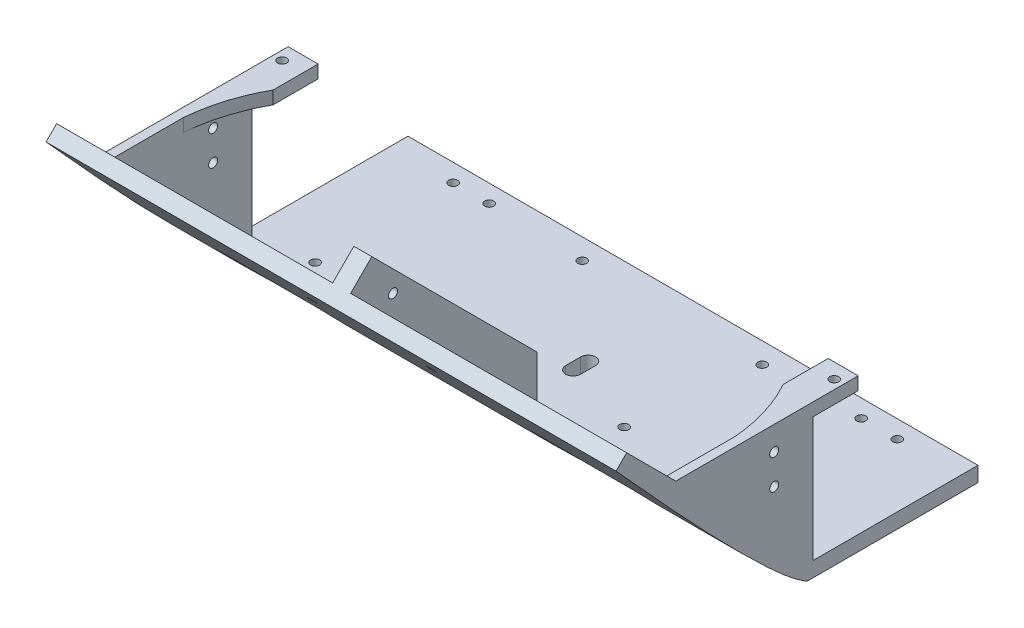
ISO-10303-21;
HEADER;
FILE_DESCRIPTION(('STEP AP214'),'2;1');
FILE_NAME('part.step','',(''),(''),'','','');
FILE_SCHEMA(('AUTOMOTIVE_DESIGN { 1 0 10303 214 1 1 1 1 }'));
ENDSEC;
DATA;
#1=APPLICATION_CONTEXT('core data for automotive mechanical design processes');
#2=APPLICATION_PROTOCOL_DEFINITION('international standard','automotive_design',2000,#1);
#3=PRODUCT_CONTEXT('',#1,'mechanical');
#4=PRODUCT('Part','Part','',(#3));
#5=PRODUCT_RELATED_PRODUCT_CATEGORY('part','',(#4));
#6=PRODUCT_DEFINITION_FORMATION('','',#4);
#7=PRODUCT_DEFINITION_CONTEXT('part definition',#1,'design');
#8=PRODUCT_DEFINITION('design','',#6,#7);
#9=PRODUCT_DEFINITION_SHAPE('','',#8);
#10=(LENGTH_UNIT() NAMED_UNIT(*) SI_UNIT(.MILLI.,.METRE.));
#11=(NAMED_UNIT(*) PLANE_ANGLE_UNIT() SI_UNIT($,.RADIAN.));
#12=(NAMED_UNIT(*) SI_UNIT($,.STERADIAN.) SOLID_ANGLE_UNIT());
#13=UNCERTAINTY_MEASURE_WITH_UNIT(LENGTH_MEASURE(1.E-05),#10,'distance_accuracy_value','');
#14=(GEOMETRIC_REPRESENTATION_CONTEXT(3) GLOBAL_UNCERTAINTY_ASSIGNED_CONTEXT((#13)) GLOBAL_UNIT_ASSIGNED_CONTEXT((#10,
#11,#12)) REPRESENTATION_CONTEXT('',''));
#15=CARTESIAN_POINT('',(0.,0.,0.));
#16=DIRECTION('',(0.,0.,1.));
#17=DIRECTION('',(1.,0.,0.));
#18=AXIS2_PLACEMENT_3D('',#15,#16,#17);
#19=CARTESIAN_POINT('',(190.,67.1751442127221,105.104076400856));
#20=DIRECTION('',(0.,-0.707106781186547,0.707106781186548));
#21=DIRECTION('',(0.,-0.707106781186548,-0.707106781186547));
#22=AXIS2_PLACEMENT_3D('',#19,#20,#21);
#23=PLANE('',#22);
#24=DIRECTION('',(1.,0.,0.));
#25=VECTOR('',#24,1.);
#26=CARTESIAN_POINT('',(60.5,35.1913223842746,73.120254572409));
#27=LINE('',#26,#25);
#28=CARTESIAN_POINT('',(25.5,35.1913223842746,73.120254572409));
#29=VERTEX_POINT('',#28);
#30=CARTESIAN_POINT('',(60.5,35.1913223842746,73.120254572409));
#31=VERTEX_POINT('',#30);
#32=EDGE_CURVE('E554',#29,#31,#27,.T.);
#33=ORIENTED_EDGE('',*,*,#32,.F.);
#34=DIRECTION('',(0.,0.707106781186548,0.707106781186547));
#35=VECTOR('',#34,1.);
#36=CARTESIAN_POINT('',(25.5,35.1913223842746,73.120254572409));
#37=LINE('',#36,#35);
#38=CARTESIAN_POINT('',(25.5,10.4425850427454,48.3715172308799));
#39=VERTEX_POINT('',#38);
#40=EDGE_CURVE('E546',#39,#29,#37,.T.);
#41=ORIENTED_EDGE('',*,*,#40,.F.);
#42=DIRECTION('',(-1.,0.,0.));
#43=VECTOR('',#42,1.);
#44=CARTESIAN_POINT('',(60.5,10.4425850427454,48.3715172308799));
#45=LINE('',#44,#43);
#46=CARTESIAN_POINT('',(60.5,10.4425850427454,48.3715172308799));
#47=VERTEX_POINT('',#46);
#48=EDGE_CURVE('E560',#47,#39,#45,.T.);
#49=ORIENTED_EDGE('',*,*,#48,.F.);
#50=DIRECTION('',(0.,-0.707106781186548,-0.707106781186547));
#51=VECTOR('',#50,1.);
#52=CARTESIAN_POINT('',(60.5,35.1913223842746,73.120254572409));
#53=LINE('',#52,#51);
#54=EDGE_CURVE('E557',#31,#47,#53,.T.);
#55=ORIENTED_EDGE('',*,*,#54,.F.);
#56=EDGE_LOOP('',(#33,#41,#49,#55));
#57=FACE_BOUND('',#56,.T.);
#58=CARTESIAN_POINT('',(75.,52.9213203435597,90.8502525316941));
#59=DIRECTION('',(0.,0.707106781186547,-0.707106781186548));
#60=DIRECTION('',(0.,0.707106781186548,0.707106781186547));
#61=AXIS2_PLACEMENT_3D('',#58,#59,#60);
#62=CIRCLE('',#61,1.5);
#63=CARTESIAN_POINT('',(75.,53.9819805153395,91.9109127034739));
#64=VERTEX_POINT('',#63);
#65=EDGE_CURVE('E396',#64,#64,#62,.T.);
#66=ORIENTED_EDGE('',*,*,#65,.F.);
#67=EDGE_LOOP('',(#66));
#68=FACE_BOUND('',#67,.T.);
#69=DIRECTION('',(0.,0.707106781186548,0.707106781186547));
#70=VECTOR('',#69,1.);
#71=CARTESIAN_POINT('',(92.,4.99999999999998,42.9289321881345));
#72=LINE('',#71,#70);
#73=CARTESIAN_POINT('',(92.,4.99999999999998,42.9289321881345));
#74=VERTEX_POINT('',#73);
#75=CARTESIAN_POINT('',(92.,67.1751442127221,105.104076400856));
#76=VERTEX_POINT('',#75);
#77=EDGE_CURVE('E371',#74,#76,#72,.T.);
#78=ORIENTED_EDGE('',*,*,#77,.F.);
#79=DIRECTION('',(-1.,0.,0.));
#80=VECTOR('',#79,1.);
#81=CARTESIAN_POINT('',(190.,4.99999999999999,42.9289321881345));
#82=LINE('',#81,#80);
#83=CARTESIAN_POINT('',(3.,4.99999999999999,42.9289321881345));
#84=VERTEX_POINT('',#83);
#85=EDGE_CURVE('E737',#74,#84,#82,.T.);
#86=ORIENTED_EDGE('',*,*,#85,.T.);
#87=DIRECTION('',(0.,0.707106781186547,0.707106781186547));
#88=VECTOR('',#87,1.);
#89=CARTESIAN_POINT('',(3.,50.8,88.7289321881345));
#90=LINE('',#89,#88);
#91=CARTESIAN_POINT('',(3.,50.8,88.7289321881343));
#92=VERTEX_POINT('',#91);
#93=EDGE_CURVE('E515',#84,#92,#90,.T.);
#94=ORIENTED_EDGE('',*,*,#93,.T.);
#95=DIRECTION('',(-1.,0.,0.));
#96=VECTOR('',#95,1.);
#97=CARTESIAN_POINT('',(3.,50.8,88.7289321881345));
#98=LINE('',#97,#96);
#99=CARTESIAN_POINT('',(0.,50.8,88.7289321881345));
#100=VERTEX_POINT('',#99);
#101=EDGE_CURVE('E524',#92,#100,#98,.T.);
#102=ORIENTED_EDGE('',*,*,#101,.T.);
#103=DIRECTION('',(0.,0.707106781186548,0.707106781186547));
#104=VECTOR('',#103,1.);
#105=CARTESIAN_POINT('',(0.,67.1751442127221,105.104076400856));
#106=LINE('',#105,#104);
#107=CARTESIAN_POINT('',(0.,67.1751442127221,105.104076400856));
#108=VERTEX_POINT('',#107);
#109=EDGE_CURVE('E848',#100,#108,#106,.T.);
#110=ORIENTED_EDGE('',*,*,#109,.T.);
#111=DIRECTION('',(-1.,0.,0.));
#112=VECTOR('',#111,1.);
#113=CARTESIAN_POINT('',(190.,67.1751442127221,105.104076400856));
#114=LINE('',#113,#112);
#115=EDGE_CURVE('E739',#76,#108,#114,.T.);
#116=ORIENTED_EDGE('',*,*,#115,.F.);
#117=EDGE_LOOP('',(#78,#86,#94,#102,#110,#116));
#118=FACE_BOUND('',#117,.T.);
#119=ADVANCED_FACE('F36',(#57,#68,#118),#23,.F.);
#120=DIRECTION('',(1.,0.,0.));
#121=VECTOR('',#120,1.);
#122=CARTESIAN_POINT('',(129.5,35.1913223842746,73.120254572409));
#123=LINE('',#122,#121);
#124=CARTESIAN_POINT('',(129.5,35.1913223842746,73.120254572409));
#125=VERTEX_POINT('',#124);
#126=CARTESIAN_POINT('',(164.5,35.1913223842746,73.120254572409));
#127=VERTEX_POINT('',#126);
#128=EDGE_CURVE('E534',#125,#127,#123,.T.);
#129=ORIENTED_EDGE('',*,*,#128,.F.);
#130=DIRECTION('',(0.,0.707106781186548,0.707106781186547));
#131=VECTOR('',#130,1.);
#132=CARTESIAN_POINT('',(129.5,35.1913223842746,73.120254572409));
#133=LINE('',#132,#131);
#134=CARTESIAN_POINT('',(129.5,10.4425850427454,48.3715172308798));
#135=VERTEX_POINT('',#134);
#136=EDGE_CURVE('E530',#135,#125,#133,.T.);
#137=ORIENTED_EDGE('',*,*,#136,.F.);
#138=DIRECTION('',(-1.,0.,0.));
#139=VECTOR('',#138,1.);
#140=CARTESIAN_POINT('',(129.5,10.4425850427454,48.3715172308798));
#141=LINE('',#140,#139);
#142=CARTESIAN_POINT('',(164.5,10.4425850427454,48.3715172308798));
#143=VERTEX_POINT('',#142);
#144=EDGE_CURVE('E540',#143,#135,#141,.T.);
#145=ORIENTED_EDGE('',*,*,#144,.F.);
#146=DIRECTION('',(0.,-0.707106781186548,-0.707106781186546));
#147=VECTOR('',#146,1.);
#148=CARTESIAN_POINT('',(164.5,35.1913223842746,73.120254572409));
#149=LINE('',#148,#147);
#150=EDGE_CURVE('E537',#127,#143,#149,.T.);
#151=ORIENTED_EDGE('',*,*,#150,.F.);
#152=EDGE_LOOP('',(#129,#137,#145,#151));
#153=FACE_BOUND('',#152,.T.);
#154=CARTESIAN_POINT('',(115.,52.9213203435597,90.8502525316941));
#155=DIRECTION('',(0.,0.707106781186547,-0.707106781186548));
#156=DIRECTION('',(0.,-0.707106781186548,-0.707106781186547));
#157=AXIS2_PLACEMENT_3D('',#154,#155,#156);
#158=CIRCLE('',#157,1.50000000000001);
#159=CARTESIAN_POINT('',(115.,51.8606601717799,89.7895923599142));
#160=VERTEX_POINT('',#159);
#161=EDGE_CURVE('E392',#160,#160,#158,.T.);
#162=ORIENTED_EDGE('',*,*,#161,.F.);
#163=EDGE_LOOP('',(#162));
#164=FACE_BOUND('',#163,.T.);
#165=DIRECTION('',(0.,-0.707106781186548,-0.707106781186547));
#166=VECTOR('',#165,1.);
#167=CARTESIAN_POINT('',(98.,4.99999999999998,42.9289321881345));
#168=LINE('',#167,#166);
#169=CARTESIAN_POINT('',(98.,67.1751442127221,105.104076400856));
#170=VERTEX_POINT('',#169);
#171=CARTESIAN_POINT('',(98.,4.99999999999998,42.9289321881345));
#172=VERTEX_POINT('',#171);
#173=EDGE_CURVE('E384',#170,#172,#168,.T.);
#174=ORIENTED_EDGE('',*,*,#173,.F.);
#175=CARTESIAN_POINT('',(190.,67.1751442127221,105.104076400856));
#176=VERTEX_POINT('',#175);
#177=EDGE_CURVE('E751',#176,#170,#114,.T.);
#178=ORIENTED_EDGE('',*,*,#177,.F.);
#179=DIRECTION('',(0.,0.707106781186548,0.707106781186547));
#180=VECTOR('',#179,1.);
#181=CARTESIAN_POINT('',(190.,67.1751442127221,105.104076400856));
#182=LINE('',#181,#180);
#183=CARTESIAN_POINT('',(190.,50.8,88.7289321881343));
#184=VERTEX_POINT('',#183);
#185=EDGE_CURVE('E576',#184,#176,#182,.T.);
#186=ORIENTED_EDGE('',*,*,#185,.F.);
#187=DIRECTION('',(1.,0.,0.));
#188=VECTOR('',#187,1.);
#189=CARTESIAN_POINT('',(187.,50.8,88.7289321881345));
#190=LINE('',#189,#188);
#191=CARTESIAN_POINT('',(187.,50.8,88.7289321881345));
#192=VERTEX_POINT('',#191);
#193=EDGE_CURVE('E508',#192,#184,#190,.T.);
#194=ORIENTED_EDGE('',*,*,#193,.F.);
#195=DIRECTION('',(0.,-0.707106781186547,-0.707106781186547));
#196=VECTOR('',#195,1.);
#197=CARTESIAN_POINT('',(187.,50.8,88.7289321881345));
#198=LINE('',#197,#196);
#199=CARTESIAN_POINT('',(187.,4.99999999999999,42.9289321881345));
#200=VERTEX_POINT('',#199);
#201=EDGE_CURVE('E499',#192,#200,#198,.T.);
#202=ORIENTED_EDGE('',*,*,#201,.T.);
#203=EDGE_CURVE('E750',#200,#172,#82,.T.);
#204=ORIENTED_EDGE('',*,*,#203,.T.);
#205=EDGE_LOOP('',(#174,#178,#186,#194,#202,#204));
#206=FACE_BOUND('',#205,.T.);
#207=ADVANCED_FACE('F721',(#153,#164,#206),#23,.F.);
#208=CARTESIAN_POINT('',(187.,4.99999999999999,42.9289321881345));
#209=DIRECTION('',(0.,0.,-1.));
#210=DIRECTION('',(-1.,0.,0.));
#211=AXIS2_PLACEMENT_3D('',#208,#209,#210);
#212=PLANE('',#211);
#213=DIRECTION('',(0.,1.,0.));
#214=VECTOR('',#213,1.);
#215=CARTESIAN_POINT('',(187.,4.99999999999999,42.9289321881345));
#216=LINE('',#215,#214);
#217=CARTESIAN_POINT('',(187.,46.5,42.9289321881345));
#218=VERTEX_POINT('',#217);
#219=EDGE_CURVE('E502',#200,#218,#216,.T.);
#220=ORIENTED_EDGE('',*,*,#219,.T.);
#221=DIRECTION('',(-1.,0.,0.));
#222=VECTOR('',#221,1.);
#223=CARTESIAN_POINT('',(190.,46.5,42.9289321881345));
#224=LINE('',#223,#222);
#225=CARTESIAN_POINT('',(190.,46.5,42.9289321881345));
#226=VERTEX_POINT('',#225);
#227=EDGE_CURVE('E450',#226,#218,#224,.T.);
#228=ORIENTED_EDGE('',*,*,#227,.F.);
#229=DIRECTION('',(0.,1.,0.));
#230=VECTOR('',#229,1.);
#231=CARTESIAN_POINT('',(190.,4.99999999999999,42.9289321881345));
#232=LINE('',#231,#230);
#233=CARTESIAN_POINT('',(190.,4.99999999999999,42.9289321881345));
#234=VERTEX_POINT('',#233);
#235=EDGE_CURVE('E498',#234,#226,#232,.T.);
#236=ORIENTED_EDGE('',*,*,#235,.F.);
#237=EDGE_CURVE('E753',#234,#200,#82,.T.);
#238=ORIENTED_EDGE('',*,*,#237,.T.);
#239=EDGE_LOOP('',(#220,#228,#236,#238));
#240=FACE_BOUND('',#239,.T.);
#241=ADVANCED_FACE('F726',(#240),#212,.T.);
#242=CARTESIAN_POINT('',(3.,4.99999999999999,42.9289321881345));
#243=DIRECTION('',(0.,0.,-1.));
#244=DIRECTION('',(-1.,0.,0.));
#245=AXIS2_PLACEMENT_3D('',#242,#243,#244);
#246=PLANE('',#245);
#247=DIRECTION('',(0.,-1.,0.));
#248=VECTOR('',#247,1.);
#249=CARTESIAN_POINT('',(0.,4.99999999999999,42.9289321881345));
#250=LINE('',#249,#248);
#251=CARTESIAN_POINT('',(0.,46.5,42.9289321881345));
#252=VERTEX_POINT('',#251);
#253=CARTESIAN_POINT('',(0.,4.99999999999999,42.9289321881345));
#254=VERTEX_POINT('',#253);
#255=EDGE_CURVE('E518',#252,#254,#250,.T.);
#256=ORIENTED_EDGE('',*,*,#255,.F.);
#257=DIRECTION('',(-1.,0.,0.));
#258=VECTOR('',#257,1.);
#259=CARTESIAN_POINT('',(0.,46.5,42.9289321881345));
#260=LINE('',#259,#258);
#261=CARTESIAN_POINT('',(3.,46.5,42.9289321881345));
#262=VERTEX_POINT('',#261);
#263=EDGE_CURVE('E479',#262,#252,#260,.T.);
#264=ORIENTED_EDGE('',*,*,#263,.F.);
#265=DIRECTION('',(0.,-1.,0.));
#266=VECTOR('',#265,1.);
#267=CARTESIAN_POINT('',(3.,4.99999999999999,42.9289321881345));
#268=LINE('',#267,#266);
#269=EDGE_CURVE('E521',#262,#84,#268,.T.);
#270=ORIENTED_EDGE('',*,*,#269,.T.);
#271=DIRECTION('',(-1.,0.,0.));
#272=VECTOR('',#271,1.);
#273=CARTESIAN_POINT('',(3.,4.99999999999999,42.9289321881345));
#274=LINE('',#273,#272);
#275=EDGE_CURVE('E527',#84,#254,#274,.T.);
#276=ORIENTED_EDGE('',*,*,#275,.T.);
#277=EDGE_LOOP('',(#256,#264,#270,#276));
#278=FACE_BOUND('',#277,.T.);
#279=ADVANCED_FACE('F887',(#278),#246,.T.);
#280=CARTESIAN_POINT('',(190.,5.,0.));
#281=DIRECTION('',(0.,-1.,0.));
#282=DIRECTION('',(0.,0.,-1.));
#283=AXIS2_PLACEMENT_3D('',#280,#281,#282);
#284=PLANE('',#283);
#285=DIRECTION('',(0.,0.,1.));
#286=VECTOR('',#285,1.);
#287=CARTESIAN_POINT('',(92.5,5.,22.9289321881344));
#288=LINE('',#287,#286);
#289=CARTESIAN_POINT('',(92.5,5.,22.9289321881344));
#290=VERTEX_POINT('',#289);
#291=CARTESIAN_POINT('',(92.5,5.,27.9289321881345));
#292=VERTEX_POINT('',#291);
#293=EDGE_CURVE('E276',#290,#292,#288,.T.);
#294=ORIENTED_EDGE('',*,*,#293,.F.);
#295=CARTESIAN_POINT('',(95.,5.,22.9289321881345));
#296=DIRECTION('',(0.,1.,0.));
#297=DIRECTION('',(0.,0.,1.));
#298=AXIS2_PLACEMENT_3D('',#295,#296,#297);
#299=CIRCLE('',#298,2.49999999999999);
#300=CARTESIAN_POINT('',(97.5,5.,22.9289321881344));
#301=VERTEX_POINT('',#300);
#302=EDGE_CURVE('E52',#301,#290,#299,.T.);
#303=ORIENTED_EDGE('',*,*,#302,.F.);
#304=DIRECTION('',(0.,0.,-1.));
#305=VECTOR('',#304,1.);
#306=CARTESIAN_POINT('',(97.5,5.,22.9289321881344));
#307=LINE('',#306,#305);
#308=CARTESIAN_POINT('',(97.5,5.,27.9289321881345));
#309=VERTEX_POINT('',#308);
#310=EDGE_CURVE('E282',#309,#301,#307,.T.);
#311=ORIENTED_EDGE('',*,*,#310,.F.);
#312=CARTESIAN_POINT('',(95.,5.,27.9289321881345));
#313=DIRECTION('',(0.,1.,0.));
#314=DIRECTION('',(0.,0.,1.));
#315=AXIS2_PLACEMENT_3D('',#312,#313,#314);
#316=CIRCLE('',#315,2.5);
#317=EDGE_CURVE('E267',#292,#309,#316,.T.);
#318=ORIENTED_EDGE('',*,*,#317,.F.);
#319=EDGE_LOOP('',(#294,#303,#311,#318));
#320=FACE_BOUND('',#319,.T.);
#321=CARTESIAN_POINT('',(125.,5.,-5.07106781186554));
#322=DIRECTION('',(0.,1.,0.));
#323=DIRECTION('',(0.,0.,-1.));
#324=AXIS2_PLACEMENT_3D('',#321,#322,#323);
#325=CIRCLE('',#324,1.5);
#326=CARTESIAN_POINT('',(125.,5.,-6.57106781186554));
#327=VERTEX_POINT('',#326);
#328=EDGE_CURVE('E289',#327,#327,#325,.T.);
#329=ORIENTED_EDGE('',*,*,#328,.F.);
#330=EDGE_LOOP('',(#329));
#331=FACE_BOUND('',#330,.T.);
#332=CARTESIAN_POINT('',(65.,5.,-5.07106781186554));
#333=DIRECTION('',(0.,1.,0.));
#334=DIRECTION('',(0.,0.,1.));
#335=AXIS2_PLACEMENT_3D('',#332,#333,#334);
#336=CIRCLE('',#335,1.5);
#337=CARTESIAN_POINT('',(65.,5.,-3.57106781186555));
#338=VERTEX_POINT('',#337);
#339=EDGE_CURVE('E295',#338,#338,#336,.T.);
#340=ORIENTED_EDGE('',*,*,#339,.F.);
#341=EDGE_LOOP('',(#340));
#342=FACE_BOUND('',#341,.T.);
#343=CARTESIAN_POINT('',(21.,5.,-6.07106781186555));
#344=DIRECTION('',(0.,1.,0.));
#345=DIRECTION('',(0.,0.,1.));
#346=AXIS2_PLACEMENT_3D('',#343,#344,#345);
#347=CIRCLE('',#346,1.5);
#348=CARTESIAN_POINT('',(21.,5.,-4.57106781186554));
#349=VERTEX_POINT('',#348);
#350=EDGE_CURVE('E299',#349,#349,#347,.T.);
#351=ORIENTED_EDGE('',*,*,#350,.F.);
#352=EDGE_LOOP('',(#351));
#353=FACE_BOUND('',#352,.T.);
#354=CARTESIAN_POINT('',(33.,5.,-6.07106781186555));
#355=DIRECTION('',(0.,1.,0.));
#356=DIRECTION('',(0.,0.,1.));
#357=AXIS2_PLACEMENT_3D('',#354,#355,#356);
#358=CIRCLE('',#357,1.5);
#359=CARTESIAN_POINT('',(33.,5.,-4.57106781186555));
#360=VERTEX_POINT('',#359);
#361=EDGE_CURVE('E303',#360,#360,#358,.T.);
#362=ORIENTED_EDGE('',*,*,#361,.F.);
#363=EDGE_LOOP('',(#362));
#364=FACE_BOUND('',#363,.T.);
#365=CARTESIAN_POINT('',(157.,5.,-6.07106781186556));
#366=DIRECTION('',(0.,1.,0.));
#367=DIRECTION('',(0.,0.,-1.));
#368=AXIS2_PLACEMENT_3D('',#365,#366,#367);
#369=CIRCLE('',#368,1.50000000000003);
#370=CARTESIAN_POINT('',(157.,5.,-7.57106781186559));
#371=VERTEX_POINT('',#370);
#372=EDGE_CURVE('E306',#371,#371,#369,.T.);
#373=ORIENTED_EDGE('',*,*,#372,.F.);
#374=EDGE_LOOP('',(#373));
#375=FACE_BOUND('',#374,.T.);
#376=CARTESIAN_POINT('',(169.,5.,-6.07106781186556));
#377=DIRECTION('',(0.,1.,0.));
#378=DIRECTION('',(0.,0.,-1.));
#379=AXIS2_PLACEMENT_3D('',#376,#377,#378);
#380=CIRCLE('',#379,1.50000000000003);
#381=CARTESIAN_POINT('',(169.,5.,-7.57106781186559));
#382=VERTEX_POINT('',#381);
#383=EDGE_CURVE('E309',#382,#382,#380,.T.);
#384=ORIENTED_EDGE('',*,*,#383,.F.);
#385=EDGE_LOOP('',(#384));
#386=FACE_BOUND('',#385,.T.);
#387=CARTESIAN_POINT('',(169.,4.99999999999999,39.9289321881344));
#388=DIRECTION('',(0.,1.,0.));
#389=DIRECTION('',(0.,0.,-1.));
#390=AXIS2_PLACEMENT_3D('',#387,#388,#389);
#391=CIRCLE('',#390,1.5);
#392=CARTESIAN_POINT('',(169.,4.99999999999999,38.4289321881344));
#393=VERTEX_POINT('',#392);
#394=EDGE_CURVE('E312',#393,#393,#391,.T.);
#395=ORIENTED_EDGE('',*,*,#394,.F.);
#396=EDGE_LOOP('',(#395));
#397=FACE_BOUND('',#396,.T.);
#398=CARTESIAN_POINT('',(21.,4.99999999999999,39.9289321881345));
#399=DIRECTION('',(0.,1.,0.));
#400=DIRECTION('',(0.,0.,1.));
#401=AXIS2_PLACEMENT_3D('',#398,#399,#400);
#402=CIRCLE('',#401,1.5);
#403=CARTESIAN_POINT('',(21.,4.99999999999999,41.4289321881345));
#404=VERTEX_POINT('',#403);
#405=EDGE_CURVE('E315',#404,#404,#402,.T.);
#406=ORIENTED_EDGE('',*,*,#405,.F.);
#407=EDGE_LOOP('',(#406));
#408=FACE_BOUND('',#407,.T.);
#409=CARTESIAN_POINT('',(120.,5.,35.9289321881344));
#410=DIRECTION('',(0.,1.,0.));
#411=DIRECTION('',(0.,0.,-1.));
#412=AXIS2_PLACEMENT_3D('',#409,#410,#411);
#413=CIRCLE('',#412,1.5);
#414=CARTESIAN_POINT('',(120.,5.,34.4289321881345));
#415=VERTEX_POINT('',#414);
#416=EDGE_CURVE('E352',#415,#415,#413,.T.);
#417=ORIENTED_EDGE('',*,*,#416,.F.);
#418=EDGE_LOOP('',(#417));
#419=FACE_BOUND('',#418,.T.);
#420=CARTESIAN_POINT('',(70.,5.,35.9289321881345));
#421=DIRECTION('',(0.,1.,0.));
#422=DIRECTION('',(0.,0.,1.));
#423=AXIS2_PLACEMENT_3D('',#420,#421,#422);
#424=CIRCLE('',#423,1.5);
#425=CARTESIAN_POINT('',(70.,5.,37.4289321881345));
#426=VERTEX_POINT('',#425);
#427=EDGE_CURVE('E356',#426,#426,#424,.T.);
#428=ORIENTED_EDGE('',*,*,#427,.F.);
#429=EDGE_LOOP('',(#428));
#430=FACE_BOUND('',#429,.T.);
#431=DIRECTION('',(-1.,0.,0.));
#432=VECTOR('',#431,1.);
#433=CARTESIAN_POINT('',(98.,4.99999999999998,42.9289321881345));
#434=LINE('',#433,#432);
#435=EDGE_CURVE('E377',#172,#74,#434,.T.);
#436=ORIENTED_EDGE('',*,*,#435,.F.);
#437=ORIENTED_EDGE('',*,*,#203,.F.);
#438=ORIENTED_EDGE('',*,*,#237,.F.);
#439=DIRECTION('',(0.,0.,1.));
#440=VECTOR('',#439,1.);
#441=CARTESIAN_POINT('',(190.,5.,0.));
#442=LINE('',#441,#440);
#443=CARTESIAN_POINT('',(190.,5.,-12.));
#444=VERTEX_POINT('',#443);
#445=EDGE_CURVE('E573',#444,#234,#442,.T.);
#446=ORIENTED_EDGE('',*,*,#445,.F.);
#447=DIRECTION('',(1.,0.,0.));
#448=VECTOR('',#447,1.);
#449=CARTESIAN_POINT('',(190.,5.,-12.));
#450=LINE('',#449,#448);
#451=CARTESIAN_POINT('',(0.,5.,-12.));
#452=VERTEX_POINT('',#451);
#453=EDGE_CURVE('E329',#452,#444,#450,.T.);
#454=ORIENTED_EDGE('',*,*,#453,.F.);
#455=DIRECTION('',(0.,0.,1.));
#456=VECTOR('',#455,1.);
#457=CARTESIAN_POINT('',(0.,5.,0.));
#458=LINE('',#457,#456);
#459=EDGE_CURVE('E566',#452,#254,#458,.T.);
#460=ORIENTED_EDGE('',*,*,#459,.T.);
#461=ORIENTED_EDGE('',*,*,#275,.F.);
#462=ORIENTED_EDGE('',*,*,#85,.F.);
#463=EDGE_LOOP('',(#436,#437,#438,#446,#454,#460,#461,#462));
#464=FACE_BOUND('',#463,.T.);
#465=ADVANCED_FACE('F38',(#320,#331,#342,#353,#364,#375,#386,#397,#408,#419,#430,#464),#284,.F.);
#466=CARTESIAN_POINT('',(190.,63.6396103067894,108.639610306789));
#467=DIRECTION('',(0.,-0.707106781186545,-0.70710678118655));
#468=DIRECTION('',(0.,0.70710678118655,-0.707106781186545));
#469=AXIS2_PLACEMENT_3D('',#466,#467,#468);
#470=PLANE('',#469);
#471=DIRECTION('',(0.,-0.70710678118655,0.707106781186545));
#472=VECTOR('',#471,1.);
#473=CARTESIAN_POINT('',(0.,63.6396103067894,108.639610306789));
#474=LINE('',#473,#472);
#475=CARTESIAN_POINT('',(0.,63.6396103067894,108.639610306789));
#476=VERTEX_POINT('',#475);
#477=EDGE_CURVE('E849',#108,#476,#474,.T.);
#478=ORIENTED_EDGE('',*,*,#477,.T.);
#479=DIRECTION('',(-1.,0.,0.));
#480=VECTOR('',#479,1.);
#481=CARTESIAN_POINT('',(190.,63.6396103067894,108.639610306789));
#482=LINE('',#481,#480);
#483=CARTESIAN_POINT('',(190.,63.6396103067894,108.639610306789));
#484=VERTEX_POINT('',#483);
#485=EDGE_CURVE('E862',#484,#476,#482,.T.);
#486=ORIENTED_EDGE('',*,*,#485,.F.);
#487=DIRECTION('',(0.,-0.70710678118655,0.707106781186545));
#488=VECTOR('',#487,1.);
#489=CARTESIAN_POINT('',(190.,63.6396103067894,108.639610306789));
#490=LINE('',#489,#488);
#491=EDGE_CURVE('E579',#176,#484,#490,.T.);
#492=ORIENTED_EDGE('',*,*,#491,.F.);
#493=ORIENTED_EDGE('',*,*,#177,.T.);
#494=DIRECTION('',(0.,-0.707106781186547,0.707106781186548));
#495=VECTOR('',#494,1.);
#496=CARTESIAN_POINT('',(98.,74.2462120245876,98.033008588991));
#497=LINE('',#496,#495);
#498=CARTESIAN_POINT('',(98.,74.2462120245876,98.033008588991));
#499=VERTEX_POINT('',#498);
#500=EDGE_CURVE('E382',#499,#170,#497,.T.);
#501=ORIENTED_EDGE('',*,*,#500,.F.);
#502=DIRECTION('',(1.,0.,0.));
#503=VECTOR('',#502,1.);
#504=CARTESIAN_POINT('',(98.,74.2462120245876,98.033008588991));
#505=LINE('',#504,#503);
#506=CARTESIAN_POINT('',(92.,74.2462120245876,98.033008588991));
#507=VERTEX_POINT('',#506);
#508=EDGE_CURVE('E376',#507,#499,#505,.T.);
#509=ORIENTED_EDGE('',*,*,#508,.F.);
#510=DIRECTION('',(0.,-0.707106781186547,0.707106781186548));
#511=VECTOR('',#510,1.);
#512=CARTESIAN_POINT('',(92.,74.2462120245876,98.033008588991));
#513=LINE('',#512,#511);
#514=EDGE_CURVE('E389',#507,#76,#513,.T.);
#515=ORIENTED_EDGE('',*,*,#514,.T.);
#516=ORIENTED_EDGE('',*,*,#115,.T.);
#517=EDGE_LOOP('',(#478,#486,#492,#493,#501,#509,#515,#516));
#518=FACE_BOUND('',#517,.T.);
#519=ADVANCED_FACE('F598',(#518),#470,.F.);
#520=CARTESIAN_POINT('',(190.,63.6396103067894,108.639610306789));
#521=CARTESIAN_POINT('',(190.,46.0088728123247,92.6846548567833));
#522=CARTESIAN_POINT('',(190.,21.0269292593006,70.0895985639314));
#523=CARTESIAN_POINT('',(190.,2.84086579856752,49.5919114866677));
#524=CARTESIAN_POINT('',(190.,0.,45.));
#525=B_SPLINE_CURVE_WITH_KNOTS('',3,(#520,#521,#522,#523,#524),.UNSPECIFIED.,.F.,.F.,(4,1,4),
(0.,0.808693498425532,1.),.UNSPECIFIED.);
#526=DIRECTION('',(-1.,0.,0.));
#527=VECTOR('',#526,1.);
#528=SURFACE_OF_LINEAR_EXTRUSION('',#525,#527);
#529=CARTESIAN_POINT('',(115.,49.8100892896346,96.0828039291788));
#530=CARTESIAN_POINT('',(115.08420391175,49.8100850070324,96.0828000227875));
#531=CARTESIAN_POINT('',(115.168495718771,49.8048255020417,96.0779930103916));
#532=CARTESIAN_POINT('',(115.293055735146,49.7891798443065,96.0636929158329));
#533=CARTESIAN_POINT('',(115.334296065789,49.7826632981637,96.0577367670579));
#534=CARTESIAN_POINT('',(115.415927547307,49.7670851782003,96.0434980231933));
#535=CARTESIAN_POINT('',(115.45631791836,49.7580213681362,96.035213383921));
#536=CARTESIAN_POINT('',(115.57561170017,49.7271261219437,96.0069733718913));
#537=CARTESIAN_POINT('',(115.652803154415,49.7015699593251,95.9836127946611));
#538=CARTESIAN_POINT('',(115.800273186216,49.6412493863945,95.9284703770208));
#539=CARTESIAN_POINT('',(115.870551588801,49.6064847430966,95.896688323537));
#540=CARTESIAN_POINT('',(115.969280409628,49.5482116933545,95.8434097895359));
#541=CARTESIAN_POINT('',(116.001100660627,49.5277452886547,95.8246967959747));
#542=CARTESIAN_POINT('',(116.06226630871,49.4849321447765,95.7855496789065));
#543=CARTESIAN_POINT('',(116.091614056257,49.4625872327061,95.7651172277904));
#544=CARTESIAN_POINT('',(116.175690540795,49.3929162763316,95.7014059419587));
#545=CARTESIAN_POINT('',(116.226476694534,49.3429397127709,95.6557001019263));
#546=CARTESIAN_POINT('',(116.315990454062,49.2373931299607,95.5591611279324));
#547=CARTESIAN_POINT('',(116.354706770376,49.1818179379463,95.5083232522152));
#548=CARTESIAN_POINT('',(116.418964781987,49.0666636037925,95.4029708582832));
#549=CARTESIAN_POINT('',(116.444506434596,49.0070844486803,95.3484563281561));
#550=CARTESIAN_POINT('',(116.481700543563,48.8855664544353,95.2372526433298));
#551=CARTESIAN_POINT('',(116.493340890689,48.8236256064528,95.1805616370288));
#552=CARTESIAN_POINT('',(116.502366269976,48.699188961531,95.0666554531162));
#553=CARTESIAN_POINT('',(116.499751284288,48.6366931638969,95.0094402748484));
#554=CARTESIAN_POINT('',(116.480334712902,48.5128945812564,94.896086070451));
#555=CARTESIAN_POINT('',(116.463527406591,48.4515922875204,94.8399474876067));
#556=CARTESIAN_POINT('',(116.416193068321,48.3319468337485,94.7303652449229));
#557=CARTESIAN_POINT('',(116.385666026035,48.2736036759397,94.6769215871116));
#558=CARTESIAN_POINT('',(116.311763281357,48.1615467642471,94.5742618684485));
#559=CARTESIAN_POINT('',(116.268390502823,48.1078319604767,94.525044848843));
#560=CARTESIAN_POINT('',(116.170021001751,48.0065440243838,94.4322276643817));
#561=CARTESIAN_POINT('',(116.115024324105,47.958970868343,94.3886274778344));
#562=CARTESIAN_POINT('',(115.995010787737,47.8713530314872,94.3083191));
#563=CARTESIAN_POINT('',(115.930001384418,47.8313027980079,94.2716058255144));
#564=CARTESIAN_POINT('',(115.79177670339,47.7598275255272,94.2060808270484));
#565=CARTESIAN_POINT('',(115.718561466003,47.7284024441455,94.1772690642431));
#566=CARTESIAN_POINT('',(115.566076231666,47.6750981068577,94.1283949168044));
#567=CARTESIAN_POINT('',(115.486811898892,47.6532100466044,94.1083244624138));
#568=CARTESIAN_POINT('',(115.324420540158,47.6195611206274,94.0774688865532));
#569=CARTESIAN_POINT('',(115.241293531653,47.6078002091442,94.0666837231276));
#570=CARTESIAN_POINT('',(115.073600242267,47.5947455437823,94.0547121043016));
#571=CARTESIAN_POINT('',(114.989035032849,47.5934443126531,94.0535187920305));
#572=CARTESIAN_POINT('',(114.820809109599,47.6013263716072,94.0607469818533));
#573=CARTESIAN_POINT('',(114.73714839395,47.610509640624,94.0691684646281));
#574=CARTESIAN_POINT('',(114.573124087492,47.6390961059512,94.0953823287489));
#575=CARTESIAN_POINT('',(114.492759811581,47.6584971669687,94.1131727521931));
#576=CARTESIAN_POINT('',(114.337588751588,47.7069659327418,94.1576145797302));
#577=CARTESIAN_POINT('',(114.262781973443,47.7360336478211,94.1842659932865));
#578=CARTESIAN_POINT('',(114.120817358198,47.8030225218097,94.2456806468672));
#579=CARTESIAN_POINT('',(114.053662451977,47.8409470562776,94.2804469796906));
#580=CARTESIAN_POINT('',(113.928934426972,47.9245665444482,94.3570945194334));
#581=CARTESIAN_POINT('',(113.871361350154,47.9702615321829,94.3989757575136));
#582=CARTESIAN_POINT('',(113.767380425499,48.0681663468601,94.4886981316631));
#583=CARTESIAN_POINT('',(113.720981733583,48.1203814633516,94.5365441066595));
#584=CARTESIAN_POINT('',(113.640720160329,48.2298163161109,94.6368083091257));
#585=CARTESIAN_POINT('',(113.606857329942,48.2870360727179,94.6892265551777));
#586=CARTESIAN_POINT('',(113.552597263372,48.404913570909,94.7971971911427));
#587=CARTESIAN_POINT('',(113.532212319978,48.4655743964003,94.8527523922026));
#588=CARTESIAN_POINT('',(113.505531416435,48.5885661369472,94.9653760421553));
#589=CARTESIAN_POINT('',(113.499235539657,48.6508970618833,95.0224445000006));
#590=CARTESIAN_POINT('',(113.500912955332,48.7755028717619,95.1365138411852));
#591=CARTESIAN_POINT('',(113.508894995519,48.8377776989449,95.1935146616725));
#592=CARTESIAN_POINT('',(113.538911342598,48.9604559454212,95.3057880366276));
#593=CARTESIAN_POINT('',(113.560945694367,49.0208593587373,95.3610605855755));
#594=CARTESIAN_POINT('',(113.618477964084,49.1381156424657,95.4683430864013));
#595=CARTESIAN_POINT('',(113.653976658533,49.1949683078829,95.5203528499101));
#596=CARTESIAN_POINT('',(113.716488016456,49.2762820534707,95.5947315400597));
#597=CARTESIAN_POINT('',(113.738873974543,49.3027302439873,95.6189225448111));
#598=CARTESIAN_POINT('',(113.786606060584,49.3541695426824,95.6659692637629));
#599=CARTESIAN_POINT('',(113.811955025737,49.3791592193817,95.6888236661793));
#600=CARTESIAN_POINT('',(113.892094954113,49.4515631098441,95.7550375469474));
#601=CARTESIAN_POINT('',(113.951059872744,49.4965172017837,95.7961437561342));
#602=CARTESIAN_POINT('',(114.078397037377,49.5784642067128,95.8710704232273));
#603=CARTESIAN_POINT('',(114.146769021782,49.615457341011,95.9048910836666));
#604=CARTESIAN_POINT('',(114.254850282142,49.6641755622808,95.9494286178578));
#605=CARTESIAN_POINT('',(114.291817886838,49.6792922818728,95.9632476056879));
#606=CARTESIAN_POINT('',(114.367310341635,49.707160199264,95.9887224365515));
#607=CARTESIAN_POINT('',(114.40583378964,49.7199134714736,96.0003801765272));
#608=CARTESIAN_POINT('',(114.523334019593,49.754478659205,96.031975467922));
#609=CARTESIAN_POINT('',(114.604361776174,49.772650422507,96.0485848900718));
#610=CARTESIAN_POINT('',(114.738242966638,49.7937783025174,96.067895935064));
#611=CARTESIAN_POINT('',(114.790238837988,49.799886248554,96.073478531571));
#612=CARTESIAN_POINT('',(114.894811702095,49.8080430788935,96.0809337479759));
#613=CARTESIAN_POINT('',(114.94738869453,49.8100919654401,96.0828063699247));
#614=CARTESIAN_POINT('',(115.,49.8100892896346,96.0828039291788));
#615=B_SPLINE_CURVE_WITH_KNOTS('',3,(#529,#530,#531,#532,#533,#534,#535,#536,#537,#538,#539,
#540,#541,#542,#543,#544,#545,#546,#547,#548,#549,#550,#551,#552,#553,#554,#555,#556,#557,#558,
#559,#560,#561,#562,#563,#564,#565,#566,#567,#568,#569,#570,#571,#572,#573,#574,#575,#576,#577,
#578,#579,#580,#581,#582,#583,#584,#585,#586,#587,#588,#589,#590,#591,#592,#593,#594,#595,#596,
#597,#598,#599,#600,#601,#602,#603,#604,#605,#606,#607,#608,#609,#610,#611,#612,#613,#614),
.UNSPECIFIED.,.T.,.F.,(4,2,2,2,2,2,2,2,2,2,2,2,2,2,2,2,2,2,2,2,2,2,2,2,2,2,2,2,2,2,2,2,2,2,2,2,
2,2,2,2,2,2,4),(0.,0.252386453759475,0.378788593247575,0.505302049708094,0.757832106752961,
1.01036855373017,1.13686310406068,1.26323601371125,1.51589007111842,1.76877974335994,
2.02167023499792,2.27478085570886,2.52789179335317,2.78110480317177,3.03431800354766,
3.28747361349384,3.54062824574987,3.793595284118,4.04656107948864,4.2992928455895,
4.55202346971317,4.80457340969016,5.05712284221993,5.30961951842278,5.56211646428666,
5.81470980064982,6.06730424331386,6.3201049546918,6.57290669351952,6.8259386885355,
7.07897218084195,7.33216075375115,7.58535013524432,7.83855412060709,7.96520254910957,
8.09197325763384,8.34502984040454,8.5980793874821,8.72473153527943,8.85127198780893,
9.10393269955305,9.26162594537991,9.4193191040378),.UNSPECIFIED.);
#616=CARTESIAN_POINT('',(115.,49.8100892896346,96.0828039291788));
#617=VERTEX_POINT('',#616);
#618=EDGE_CURVE('E395',#617,#617,#615,.T.);
#619=ORIENTED_EDGE('',*,*,#618,.T.);
#620=EDGE_LOOP('',(#619));
#621=FACE_BOUND('',#620,.T.);
#622=CARTESIAN_POINT('',(75.,49.8100892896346,96.0828039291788));
#623=CARTESIAN_POINT('',(75.0842039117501,49.8100850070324,96.0828000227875));
#624=CARTESIAN_POINT('',(75.1684957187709,49.8048255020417,96.0779930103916));
#625=CARTESIAN_POINT('',(75.2930557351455,49.7891798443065,96.0636929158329));
#626=CARTESIAN_POINT('',(75.3342960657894,49.7826632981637,96.0577367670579));
#627=CARTESIAN_POINT('',(75.4159275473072,49.7670851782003,96.0434980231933));
#628=CARTESIAN_POINT('',(75.4563179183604,49.7580213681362,96.035213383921));
#629=CARTESIAN_POINT('',(75.5756117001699,49.7271261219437,96.0069733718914));
#630=CARTESIAN_POINT('',(75.6528031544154,49.7015699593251,95.9836127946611));
#631=CARTESIAN_POINT('',(75.800273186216,49.6412493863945,95.9284703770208));
#632=CARTESIAN_POINT('',(75.8705515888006,49.6064847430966,95.896688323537));
#633=CARTESIAN_POINT('',(75.9692804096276,49.5482116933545,95.8434097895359));
#634=CARTESIAN_POINT('',(76.0011006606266,49.5277452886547,95.8246967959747));
#635=CARTESIAN_POINT('',(76.0622663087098,49.4849321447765,95.7855496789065));
#636=CARTESIAN_POINT('',(76.0916140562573,49.4625872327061,95.7651172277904));
#637=CARTESIAN_POINT('',(76.1756905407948,49.3929162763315,95.7014059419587));
#638=CARTESIAN_POINT('',(76.2264766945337,49.3429397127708,95.6557001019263));
#639=CARTESIAN_POINT('',(76.3159904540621,49.2373931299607,95.5591611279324));
#640=CARTESIAN_POINT('',(76.3547067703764,49.1818179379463,95.5083232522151));
#641=CARTESIAN_POINT('',(76.4189647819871,49.0666636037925,95.4029708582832));
#642=CARTESIAN_POINT('',(76.4445064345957,49.0070844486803,95.3484563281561));
#643=CARTESIAN_POINT('',(76.4817005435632,48.8855664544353,95.2372526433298));
#644=CARTESIAN_POINT('',(76.4933408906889,48.8236256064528,95.1805616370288));
#645=CARTESIAN_POINT('',(76.5023662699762,48.699188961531,95.0666554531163));
#646=CARTESIAN_POINT('',(76.4997512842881,48.6366931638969,95.0094402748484));
#647=CARTESIAN_POINT('',(76.4803347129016,48.5128945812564,94.896086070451));
#648=CARTESIAN_POINT('',(76.4635274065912,48.4515922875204,94.8399474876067));
#649=CARTESIAN_POINT('',(76.4161930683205,48.3319468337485,94.7303652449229));
#650=CARTESIAN_POINT('',(76.3856660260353,48.2736036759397,94.6769215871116));
#651=CARTESIAN_POINT('',(76.3117632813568,48.1615467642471,94.5742618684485));
#652=CARTESIAN_POINT('',(76.2683905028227,48.1078319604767,94.525044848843));
#653=CARTESIAN_POINT('',(76.1700210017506,48.0065440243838,94.4322276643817));
#654=CARTESIAN_POINT('',(76.1150243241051,47.958970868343,94.3886274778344));
#655=CARTESIAN_POINT('',(75.9950107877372,47.8713530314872,94.3083191));
#656=CARTESIAN_POINT('',(75.9300013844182,47.8313027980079,94.2716058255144));
#657=CARTESIAN_POINT('',(75.7917767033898,47.7598275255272,94.2060808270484));
#658=CARTESIAN_POINT('',(75.7185614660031,47.7284024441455,94.1772690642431));
#659=CARTESIAN_POINT('',(75.5660762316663,47.6750981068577,94.1283949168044));
#660=CARTESIAN_POINT('',(75.4868118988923,47.6532100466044,94.1083244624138));
#661=CARTESIAN_POINT('',(75.3244205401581,47.6195611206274,94.0774688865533));
#662=CARTESIAN_POINT('',(75.2412935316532,47.6078002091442,94.0666837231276));
#663=CARTESIAN_POINT('',(75.0736002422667,47.5947455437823,94.0547121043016));
#664=CARTESIAN_POINT('',(74.9890350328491,47.5934443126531,94.0535187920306));
#665=CARTESIAN_POINT('',(74.8208091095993,47.6013263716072,94.0607469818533));
#666=CARTESIAN_POINT('',(74.7371483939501,47.610509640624,94.0691684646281));
#667=CARTESIAN_POINT('',(74.5731240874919,47.6390961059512,94.0953823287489));
#668=CARTESIAN_POINT('',(74.4927598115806,47.6584971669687,94.1131727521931));
#669=CARTESIAN_POINT('',(74.3375887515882,47.7069659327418,94.1576145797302));
#670=CARTESIAN_POINT('',(74.2627819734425,47.7360336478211,94.1842659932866));
#671=CARTESIAN_POINT('',(74.1208173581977,47.8030225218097,94.2456806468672));
#672=CARTESIAN_POINT('',(74.0536624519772,47.8409470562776,94.2804469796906));
#673=CARTESIAN_POINT('',(73.9289344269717,47.9245665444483,94.3570945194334));
#674=CARTESIAN_POINT('',(73.8713613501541,47.9702615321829,94.3989757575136));
#675=CARTESIAN_POINT('',(73.7673804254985,48.0681663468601,94.4886981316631));
#676=CARTESIAN_POINT('',(73.7209817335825,48.1203814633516,94.5365441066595));
#677=CARTESIAN_POINT('',(73.6407201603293,48.2298163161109,94.6368083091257));
#678=CARTESIAN_POINT('',(73.6068573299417,48.2870360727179,94.6892265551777));
#679=CARTESIAN_POINT('',(73.5525972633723,48.404913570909,94.7971971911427));
#680=CARTESIAN_POINT('',(73.5322123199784,48.4655743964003,94.8527523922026));
#681=CARTESIAN_POINT('',(73.5055314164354,48.5885661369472,94.9653760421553));
#682=CARTESIAN_POINT('',(73.499235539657,48.6508970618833,95.0224445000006));
#683=CARTESIAN_POINT('',(73.5009129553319,48.7755028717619,95.1365138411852));
#684=CARTESIAN_POINT('',(73.5088949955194,48.8377776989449,95.1935146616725));
#685=CARTESIAN_POINT('',(73.5389113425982,48.9604559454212,95.3057880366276));
#686=CARTESIAN_POINT('',(73.5609456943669,49.0208593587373,95.3610605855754));
#687=CARTESIAN_POINT('',(73.6184779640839,49.1381156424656,95.4683430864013));
#688=CARTESIAN_POINT('',(73.6539766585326,49.1949683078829,95.5203528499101));
#689=CARTESIAN_POINT('',(73.7164880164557,49.2762820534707,95.5947315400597));
#690=CARTESIAN_POINT('',(73.7388739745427,49.3027302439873,95.6189225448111));
#691=CARTESIAN_POINT('',(73.7866060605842,49.3541695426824,95.6659692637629));
#692=CARTESIAN_POINT('',(73.811955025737,49.3791592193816,95.6888236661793));
#693=CARTESIAN_POINT('',(73.8920949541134,49.451563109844,95.7550375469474));
#694=CARTESIAN_POINT('',(73.9510598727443,49.4965172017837,95.7961437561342));
#695=CARTESIAN_POINT('',(74.0783970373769,49.5784642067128,95.8710704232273));
#696=CARTESIAN_POINT('',(74.1467690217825,49.615457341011,95.9048910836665));
#697=CARTESIAN_POINT('',(74.2548502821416,49.6641755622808,95.9494286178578));
#698=CARTESIAN_POINT('',(74.2918178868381,49.6792922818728,95.9632476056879));
#699=CARTESIAN_POINT('',(74.3673103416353,49.707160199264,95.9887224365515));
#700=CARTESIAN_POINT('',(74.4058337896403,49.7199134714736,96.0003801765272));
#701=CARTESIAN_POINT('',(74.5233340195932,49.754478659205,96.031975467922));
#702=CARTESIAN_POINT('',(74.6043617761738,49.7726504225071,96.0485848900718));
#703=CARTESIAN_POINT('',(74.7382429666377,49.7937783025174,96.067895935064));
#704=CARTESIAN_POINT('',(74.7902388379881,49.799886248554,96.073478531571));
#705=CARTESIAN_POINT('',(74.8948117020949,49.8080430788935,96.0809337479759));
#706=CARTESIAN_POINT('',(74.9473886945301,49.8100919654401,96.0828063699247));
#707=CARTESIAN_POINT('',(75.,49.8100892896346,96.0828039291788));
#708=B_SPLINE_CURVE_WITH_KNOTS('',3,(#622,#623,#624,#625,#626,#627,#628,#629,#630,#631,#632,
#633,#634,#635,#636,#637,#638,#639,#640,#641,#642,#643,#644,#645,#646,#647,#648,#649,#650,#651,
#652,#653,#654,#655,#656,#657,#658,#659,#660,#661,#662,#663,#664,#665,#666,#667,#668,#669,#670,
#671,#672,#673,#674,#675,#676,#677,#678,#679,#680,#681,#682,#683,#684,#685,#686,#687,#688,#689,
#690,#691,#692,#693,#694,#695,#696,#697,#698,#699,#700,#701,#702,#703,#704,#705,#706,#707),
.UNSPECIFIED.,.T.,.F.,(4,2,2,2,2,2,2,2,2,2,2,2,2,2,2,2,2,2,2,2,2,2,2,2,2,2,2,2,2,2,2,2,2,2,2,2,
2,2,2,2,2,2,4),(0.,0.252386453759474,0.378788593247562,0.505302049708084,0.757832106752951,
1.01036855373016,1.13686310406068,1.26323601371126,1.51589007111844,1.76877974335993,
2.0216702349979,2.27478085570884,2.52789179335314,2.78110480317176,3.03431800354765,
3.2874736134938,3.54062824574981,3.79359528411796,4.0465610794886,4.29929284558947,
4.55202346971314,4.80457340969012,5.0571228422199,5.30961951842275,5.56211646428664,
5.81470980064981,6.06730424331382,6.32010495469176,6.5729066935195,6.82593868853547,
7.07897218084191,7.33216075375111,7.58535013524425,7.83855412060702,7.9652025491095,
8.09197325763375,8.34502984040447,8.59807938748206,8.72473153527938,8.85127198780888,
9.10393269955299,9.26162594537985,9.41931910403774),.UNSPECIFIED.);
#709=CARTESIAN_POINT('',(75.,49.8100892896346,96.0828039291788));
#710=VERTEX_POINT('',#709);
#711=EDGE_CURVE('E399',#710,#710,#708,.T.);
#712=ORIENTED_EDGE('',*,*,#711,.T.);
#713=EDGE_LOOP('',(#712));
#714=FACE_BOUND('',#713,.T.);
#715=DIRECTION('',(-1.,0.,0.));
#716=VECTOR('',#715,1.);
#717=CARTESIAN_POINT('',(190.,5.89998474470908,52.9141175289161));
#718=LINE('',#717,#716);
#719=CARTESIAN_POINT('',(164.5,5.89998474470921,52.914117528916));
#720=VERTEX_POINT('',#719);
#721=CARTESIAN_POINT('',(129.5,5.89998474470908,52.9141175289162));
#722=VERTEX_POINT('',#721);
#723=EDGE_CURVE('E791',#720,#722,#718,.T.);
#724=ORIENTED_EDGE('',*,*,#723,.T.);
#725=CARTESIAN_POINT('',(129.5,63.6396103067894,108.639610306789));
#726=CARTESIAN_POINT('',(129.5,46.0088728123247,92.6846548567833));
#727=CARTESIAN_POINT('',(129.5,21.0269292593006,70.0895985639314));
#728=CARTESIAN_POINT('',(129.5,2.84086579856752,49.5919114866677));
#729=CARTESIAN_POINT('',(129.5,0.,45.));
#730=B_SPLINE_CURVE_WITH_KNOTS('',3,(#725,#726,#727,#728,#729),.UNSPECIFIED.,.F.,.F.,(4,1,4),
(0.,0.808693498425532,1.),.UNSPECIFIED.);
#731=CARTESIAN_POINT('',(129.5,30.3635771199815,77.9479998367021));
#732=VERTEX_POINT('',#731);
#733=EDGE_CURVE('E796',#722,#732,#730,.F.);
#734=ORIENTED_EDGE('',*,*,#733,.T.);
#735=DIRECTION('',(-1.,0.,0.));
#736=VECTOR('',#735,1.);
#737=CARTESIAN_POINT('',(190.,30.3635771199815,77.9479998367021));
#738=LINE('',#737,#736);
#739=CARTESIAN_POINT('',(164.5,30.3635771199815,77.9479998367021));
#740=VERTEX_POINT('',#739);
#741=EDGE_CURVE('E780',#732,#740,#738,.F.);
#742=ORIENTED_EDGE('',*,*,#741,.T.);
#743=CARTESIAN_POINT('',(164.5,63.6396103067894,108.639610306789));
#744=CARTESIAN_POINT('',(164.5,46.0088728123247,92.6846548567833));
#745=CARTESIAN_POINT('',(164.5,21.0269292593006,70.0895985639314));
#746=CARTESIAN_POINT('',(164.5,2.84086579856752,49.5919114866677));
#747=CARTESIAN_POINT('',(164.5,0.,45.));
#748=B_SPLINE_CURVE_WITH_KNOTS('',3,(#743,#744,#745,#746,#747),.UNSPECIFIED.,.F.,.F.,(4,1,4),
(0.,0.808693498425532,1.),.UNSPECIFIED.);
#749=EDGE_CURVE('E786',#740,#720,#748,.T.);
#750=ORIENTED_EDGE('',*,*,#749,.T.);
#751=EDGE_LOOP('',(#724,#734,#742,#750));
#752=FACE_BOUND('',#751,.T.);
#753=DIRECTION('',(-1.,0.,0.));
#754=VECTOR('',#753,1.);
#755=CARTESIAN_POINT('',(190.,5.89998474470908,52.9141175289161));
#756=LINE('',#755,#754);
#757=CARTESIAN_POINT('',(60.5,5.89998474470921,52.914117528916));
#758=VERTEX_POINT('',#757);
#759=CARTESIAN_POINT('',(25.5,5.89998474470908,52.9141175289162));
#760=VERTEX_POINT('',#759);
#761=EDGE_CURVE('E766',#758,#760,#756,.T.);
#762=ORIENTED_EDGE('',*,*,#761,.T.);
#763=CARTESIAN_POINT('',(25.5,63.6396103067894,108.639610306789));
#764=CARTESIAN_POINT('',(25.5,46.0088728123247,92.6846548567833));
#765=CARTESIAN_POINT('',(25.5,21.0269292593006,70.0895985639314));
#766=CARTESIAN_POINT('',(25.5,2.84086579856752,49.5919114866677));
#767=CARTESIAN_POINT('',(25.5,0.,45.));
#768=B_SPLINE_CURVE_WITH_KNOTS('',3,(#763,#764,#765,#766,#767),.UNSPECIFIED.,.F.,.F.,(4,1,4),
(0.,0.808693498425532,1.),.UNSPECIFIED.);
#769=CARTESIAN_POINT('',(25.5,30.3635771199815,77.9479998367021));
#770=VERTEX_POINT('',#769);
#771=EDGE_CURVE('E776',#760,#770,#768,.F.);
#772=ORIENTED_EDGE('',*,*,#771,.T.);
#773=DIRECTION('',(-1.,0.,0.));
#774=VECTOR('',#773,1.);
#775=CARTESIAN_POINT('',(190.,30.3635771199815,77.9479998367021));
#776=LINE('',#775,#774);
#777=CARTESIAN_POINT('',(60.5,30.3635771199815,77.9479998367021));
#778=VERTEX_POINT('',#777);
#779=EDGE_CURVE('E757',#770,#778,#776,.F.);
#780=ORIENTED_EDGE('',*,*,#779,.T.);
#781=CARTESIAN_POINT('',(60.5,63.6396103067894,108.639610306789));
#782=CARTESIAN_POINT('',(60.5,46.0088728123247,92.6846548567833));
#783=CARTESIAN_POINT('',(60.5,21.0269292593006,70.0895985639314));
#784=CARTESIAN_POINT('',(60.5,2.84086579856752,49.5919114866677));
#785=CARTESIAN_POINT('',(60.5,0.,45.));
#786=B_SPLINE_CURVE_WITH_KNOTS('',3,(#781,#782,#783,#784,#785),.UNSPECIFIED.,.F.,.F.,(4,1,4),
(0.,0.808693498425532,1.),.UNSPECIFIED.);
#787=EDGE_CURVE('E762',#778,#758,#786,.T.);
#788=ORIENTED_EDGE('',*,*,#787,.T.);
#789=EDGE_LOOP('',(#762,#772,#780,#788));
#790=FACE_BOUND('',#789,.T.);
#791=CARTESIAN_POINT('',(0.,63.6396103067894,108.639610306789));
#792=CARTESIAN_POINT('',(0.,46.0088728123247,92.6846548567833));
#793=CARTESIAN_POINT('',(0.,21.0269292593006,70.0895985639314));
#794=CARTESIAN_POINT('',(0.,2.84086579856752,49.5919114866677));
#795=CARTESIAN_POINT('',(0.,0.,45.));
#796=B_SPLINE_CURVE_WITH_KNOTS('',3,(#791,#792,#793,#794,#795),.UNSPECIFIED.,.F.,.F.,(4,1,4),
(0.,0.808693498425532,1.),.UNSPECIFIED.);
#797=CARTESIAN_POINT('',(0.,0.,45.));
#798=VERTEX_POINT('',#797);
#799=EDGE_CURVE('E853',#476,#798,#796,.T.);
#800=ORIENTED_EDGE('',*,*,#799,.T.);
#801=DIRECTION('',(-1.,0.,0.));
#802=VECTOR('',#801,1.);
#803=CARTESIAN_POINT('',(190.,0.,45.));
#804=LINE('',#803,#802);
#805=CARTESIAN_POINT('',(190.,0.,45.));
#806=VERTEX_POINT('',#805);
#807=EDGE_CURVE('E843',#806,#798,#804,.T.);
#808=ORIENTED_EDGE('',*,*,#807,.F.);
#809=EDGE_CURVE('E581',#484,#806,#525,.T.);
#810=ORIENTED_EDGE('',*,*,#809,.F.);
#811=ORIENTED_EDGE('',*,*,#485,.T.);
#812=EDGE_LOOP('',(#800,#808,#810,#811));
#813=FACE_BOUND('',#812,.T.);
#814=ADVANCED_FACE('F592',(#621,#714,#752,#790,#813),#528,.F.);
#815=CARTESIAN_POINT('',(190.,0.,0.));
#816=DIRECTION('',(0.,1.,0.));
#817=DIRECTION('',(0.,0.,1.));
#818=AXIS2_PLACEMENT_3D('',#815,#816,#817);
#819=PLANE('',#818);
#820=DIRECTION('',(0.,0.,-1.));
#821=VECTOR('',#820,1.);
#822=CARTESIAN_POINT('',(97.4999999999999,0.,2.56739074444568E-13));
#823=LINE('',#822,#821);
#824=CARTESIAN_POINT('',(97.5,0.,27.9289321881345));
#825=VERTEX_POINT('',#824);
#826=CARTESIAN_POINT('',(97.5,0.,22.9289321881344));
#827=VERTEX_POINT('',#826);
#828=EDGE_CURVE('E45',#825,#827,#823,.T.);
#829=ORIENTED_EDGE('',*,*,#828,.T.);
#830=CARTESIAN_POINT('',(95.,0.,22.9289321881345));
#831=DIRECTION('',(0.,1.,0.));
#832=DIRECTION('',(0.,0.,1.));
#833=AXIS2_PLACEMENT_3D('',#830,#831,#832);
#834=CIRCLE('',#833,2.49999999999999);
#835=CARTESIAN_POINT('',(92.5,0.,22.9289321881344));
#836=VERTEX_POINT('',#835);
#837=EDGE_CURVE('E11',#827,#836,#834,.T.);
#838=ORIENTED_EDGE('',*,*,#837,.T.);
#839=DIRECTION('',(0.,0.,1.));
#840=VECTOR('',#839,1.);
#841=CARTESIAN_POINT('',(92.5000000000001,0.,-2.70616862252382E-13));
#842=LINE('',#841,#840);
#843=CARTESIAN_POINT('',(92.5,0.,27.9289321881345));
#844=VERTEX_POINT('',#843);
#845=EDGE_CURVE('E805',#836,#844,#842,.T.);
#846=ORIENTED_EDGE('',*,*,#845,.T.);
#847=CARTESIAN_POINT('',(95.,0.,27.9289321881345));
#848=DIRECTION('',(0.,1.,0.));
#849=DIRECTION('',(0.,0.,1.));
#850=AXIS2_PLACEMENT_3D('',#847,#848,#849);
#851=CIRCLE('',#850,2.5);
#852=EDGE_CURVE('E270',#844,#825,#851,.T.);
#853=ORIENTED_EDGE('',*,*,#852,.T.);
#854=EDGE_LOOP('',(#829,#838,#846,#853));
#855=FACE_BOUND('',#854,.T.);
#856=CARTESIAN_POINT('',(125.,0.,-5.07106781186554));
#857=DIRECTION('',(0.,1.,0.));
#858=DIRECTION('',(0.,0.,1.));
#859=AXIS2_PLACEMENT_3D('',#856,#857,#858);
#860=CIRCLE('',#859,1.5);
#861=CARTESIAN_POINT('',(125.,0.,-3.57106781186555));
#862=VERTEX_POINT('',#861);
#863=EDGE_CURVE('E294',#862,#862,#860,.T.);
#864=ORIENTED_EDGE('',*,*,#863,.T.);
#865=EDGE_LOOP('',(#864));
#866=FACE_BOUND('',#865,.T.);
#867=CARTESIAN_POINT('',(65.,0.,-5.07106781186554));
#868=DIRECTION('',(0.,1.,0.));
#869=DIRECTION('',(0.,0.,1.));
#870=AXIS2_PLACEMENT_3D('',#867,#868,#869);
#871=CIRCLE('',#870,1.5);
#872=CARTESIAN_POINT('',(65.,0.,-3.57106781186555));
#873=VERTEX_POINT('',#872);
#874=EDGE_CURVE('E298',#873,#873,#871,.T.);
#875=ORIENTED_EDGE('',*,*,#874,.T.);
#876=EDGE_LOOP('',(#875));
#877=FACE_BOUND('',#876,.T.);
#878=CARTESIAN_POINT('',(21.,0.,-6.07106781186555));
#879=DIRECTION('',(0.,1.,0.));
#880=DIRECTION('',(0.,0.,1.));
#881=AXIS2_PLACEMENT_3D('',#878,#879,#880);
#882=CIRCLE('',#881,1.5);
#883=CARTESIAN_POINT('',(21.,0.,-4.57106781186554));
#884=VERTEX_POINT('',#883);
#885=EDGE_CURVE('E319',#884,#884,#882,.T.);
#886=ORIENTED_EDGE('',*,*,#885,.T.);
#887=EDGE_LOOP('',(#886));
#888=FACE_BOUND('',#887,.T.);
#889=CARTESIAN_POINT('',(33.,0.,-6.07106781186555));
#890=DIRECTION('',(0.,1.,0.));
#891=DIRECTION('',(0.,0.,1.));
#892=AXIS2_PLACEMENT_3D('',#889,#890,#891);
#893=CIRCLE('',#892,1.5);
#894=CARTESIAN_POINT('',(33.,0.,-4.57106781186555));
#895=VERTEX_POINT('',#894);
#896=EDGE_CURVE('E1388',#895,#895,#893,.T.);
#897=ORIENTED_EDGE('',*,*,#896,.T.);
#898=EDGE_LOOP('',(#897));
#899=FACE_BOUND('',#898,.T.);
#900=CARTESIAN_POINT('',(157.,0.,-6.07106781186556));
#901=DIRECTION('',(0.,1.,0.));
#902=DIRECTION('',(0.,0.,1.));
#903=AXIS2_PLACEMENT_3D('',#900,#901,#902);
#904=CIRCLE('',#903,1.50000000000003);
#905=CARTESIAN_POINT('',(157.,0.,-4.57106781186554));
#906=VERTEX_POINT('',#905);
#907=EDGE_CURVE('E1385',#906,#906,#904,.T.);
#908=ORIENTED_EDGE('',*,*,#907,.T.);
#909=EDGE_LOOP('',(#908));
#910=FACE_BOUND('',#909,.T.);
#911=CARTESIAN_POINT('',(169.,0.,-6.07106781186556));
#912=DIRECTION('',(0.,1.,0.));
#913=DIRECTION('',(0.,0.,1.));
#914=AXIS2_PLACEMENT_3D('',#911,#912,#913);
#915=CIRCLE('',#914,1.50000000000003);
#916=CARTESIAN_POINT('',(169.,0.,-4.57106781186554));
#917=VERTEX_POINT('',#916);
#918=EDGE_CURVE('E1382',#917,#917,#915,.T.);
#919=ORIENTED_EDGE('',*,*,#918,.T.);
#920=EDGE_LOOP('',(#919));
#921=FACE_BOUND('',#920,.T.);
#922=CARTESIAN_POINT('',(169.,0.,39.9289321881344));
#923=DIRECTION('',(0.,1.,0.));
#924=DIRECTION('',(0.,0.,1.));
#925=AXIS2_PLACEMENT_3D('',#922,#923,#924);
#926=CIRCLE('',#925,1.5);
#927=CARTESIAN_POINT('',(169.,0.,41.4289321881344));
#928=VERTEX_POINT('',#927);
#929=EDGE_CURVE('E302',#928,#928,#926,.T.);
#930=ORIENTED_EDGE('',*,*,#929,.T.);
#931=EDGE_LOOP('',(#930));
#932=FACE_BOUND('',#931,.T.);
#933=CARTESIAN_POINT('',(21.,0.,39.9289321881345));
#934=DIRECTION('',(0.,1.,0.));
#935=DIRECTION('',(0.,0.,1.));
#936=AXIS2_PLACEMENT_3D('',#933,#934,#935);
#937=CIRCLE('',#936,1.5);
#938=CARTESIAN_POINT('',(21.,0.,41.4289321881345));
#939=VERTEX_POINT('',#938);
#940=EDGE_CURVE('E318',#939,#939,#937,.T.);
#941=ORIENTED_EDGE('',*,*,#940,.T.);
#942=EDGE_LOOP('',(#941));
#943=FACE_BOUND('',#942,.T.);
#944=CARTESIAN_POINT('',(120.,0.,35.9289321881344));
#945=DIRECTION('',(0.,1.,0.));
#946=DIRECTION('',(0.,0.,1.));
#947=AXIS2_PLACEMENT_3D('',#944,#945,#946);
#948=CIRCLE('',#947,1.5);
#949=CARTESIAN_POINT('',(120.,0.,37.4289321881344));
#950=VERTEX_POINT('',#949);
#951=EDGE_CURVE('E355',#950,#950,#948,.T.);
#952=ORIENTED_EDGE('',*,*,#951,.T.);
#953=EDGE_LOOP('',(#952));
#954=FACE_BOUND('',#953,.T.);
#955=CARTESIAN_POINT('',(70.,0.,35.9289321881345));
#956=DIRECTION('',(0.,1.,0.));
#957=DIRECTION('',(0.,0.,1.));
#958=AXIS2_PLACEMENT_3D('',#955,#956,#957);
#959=CIRCLE('',#958,1.5);
#960=CARTESIAN_POINT('',(70.,0.,37.4289321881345));
#961=VERTEX_POINT('',#960);
#962=EDGE_CURVE('E359',#961,#961,#959,.T.);
#963=ORIENTED_EDGE('',*,*,#962,.T.);
#964=EDGE_LOOP('',(#963));
#965=FACE_BOUND('',#964,.T.);
#966=DIRECTION('',(0.,0.,-1.));
#967=VECTOR('',#966,1.);
#968=CARTESIAN_POINT('',(0.,0.,0.));
#969=LINE('',#968,#967);
#970=CARTESIAN_POINT('',(0.,0.,-12.));
#971=VERTEX_POINT('',#970);
#972=EDGE_CURVE('E577',#798,#971,#969,.T.);
#973=ORIENTED_EDGE('',*,*,#972,.T.);
#974=DIRECTION('',(-1.,0.,0.));
#975=VECTOR('',#974,1.);
#976=CARTESIAN_POINT('',(190.,0.,-12.));
#977=LINE('',#976,#975);
#978=CARTESIAN_POINT('',(190.,0.,-12.));
#979=VERTEX_POINT('',#978);
#980=EDGE_CURVE('E323',#979,#971,#977,.T.);
#981=ORIENTED_EDGE('',*,*,#980,.F.);
#982=DIRECTION('',(0.,0.,-1.));
#983=VECTOR('',#982,1.);
#984=CARTESIAN_POINT('',(190.,0.,0.));
#985=LINE('',#984,#983);
#986=EDGE_CURVE('E586',#806,#979,#985,.T.);
#987=ORIENTED_EDGE('',*,*,#986,.F.);
#988=ORIENTED_EDGE('',*,*,#807,.T.);
#989=EDGE_LOOP('',(#973,#981,#987,#988));
#990=FACE_BOUND('',#989,.T.);
#991=ADVANCED_FACE('F597',(#855,#866,#877,#888,#899,#910,#921,#932,#943,#954,#965,#990),#819,.F.);
#992=CARTESIAN_POINT('',(190.,29.6460796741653,77.2598362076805));
#993=DIRECTION('',(1.,0.,0.));
#994=DIRECTION('',(0.,0.,-1.));
#995=AXIS2_PLACEMENT_3D('',#992,#993,#994);
#996=PLANE('',#995);
#997=CARTESIAN_POINT('',(190.,42.8,55.9289321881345));
#998=DIRECTION('',(1.,0.,0.));
#999=DIRECTION('',(0.,0.,-1.));
#1000=AXIS2_PLACEMENT_3D('',#997,#998,#999);
#1001=CIRCLE('',#1000,1.5);
#1002=CARTESIAN_POINT('',(190.,42.8,54.4289321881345));
#1003=VERTEX_POINT('',#1002);
#1004=EDGE_CURVE('E335',#1003,#1003,#1001,.T.);
#1005=ORIENTED_EDGE('',*,*,#1004,.F.);
#1006=EDGE_LOOP('',(#1005));
#1007=FACE_BOUND('',#1006,.T.);
#1008=CARTESIAN_POINT('',(190.,32.8,55.9289321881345));
#1009=DIRECTION('',(1.,0.,0.));
#1010=DIRECTION('',(0.,0.,-1.));
#1011=AXIS2_PLACEMENT_3D('',#1008,#1009,#1010);
#1012=CIRCLE('',#1011,1.5);
#1013=CARTESIAN_POINT('',(190.,32.8,54.4289321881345));
#1014=VERTEX_POINT('',#1013);
#1015=EDGE_CURVE('E341',#1014,#1014,#1012,.T.);
#1016=ORIENTED_EDGE('',*,*,#1015,.F.);
#1017=EDGE_LOOP('',(#1016));
#1018=FACE_BOUND('',#1017,.T.);
#1019=ORIENTED_EDGE('',*,*,#986,.T.);
#1020=DIRECTION('',(0.,-1.,0.));
#1021=VECTOR('',#1020,1.);
#1022=CARTESIAN_POINT('',(190.,5.,-12.));
#1023=LINE('',#1022,#1021);
#1024=EDGE_CURVE('E320',#444,#979,#1023,.T.);
#1025=ORIENTED_EDGE('',*,*,#1024,.F.);
#1026=ORIENTED_EDGE('',*,*,#445,.T.);
#1027=ORIENTED_EDGE('',*,*,#235,.T.);
#1028=DIRECTION('',(0.,0.,1.));
#1029=VECTOR('',#1028,1.);
#1030=CARTESIAN_POINT('',(190.,46.5,27.9289321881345));
#1031=LINE('',#1030,#1029);
#1032=CARTESIAN_POINT('',(190.,46.5,27.9289321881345));
#1033=VERTEX_POINT('',#1032);
#1034=EDGE_CURVE('E471',#1033,#226,#1031,.T.);
#1035=ORIENTED_EDGE('',*,*,#1034,.F.);
#1036=DIRECTION('',(0.,-1.,0.));
#1037=VECTOR('',#1036,1.);
#1038=CARTESIAN_POINT('',(190.,50.8,27.9289321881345));
#1039=LINE('',#1038,#1037);
#1040=CARTESIAN_POINT('',(190.,50.8,27.9289321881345));
#1041=VERTEX_POINT('',#1040);
#1042=EDGE_CURVE('E454',#1041,#1033,#1039,.T.);
#1043=ORIENTED_EDGE('',*,*,#1042,.F.);
#1044=DIRECTION('',(0.,0.,1.));
#1045=VECTOR('',#1044,1.);
#1046=CARTESIAN_POINT('',(190.,50.8,42.9289321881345));
#1047=LINE('',#1046,#1045);
#1048=EDGE_CURVE('E503',#1041,#184,#1047,.T.);
#1049=ORIENTED_EDGE('',*,*,#1048,.T.);
#1050=ORIENTED_EDGE('',*,*,#185,.T.);
#1051=ORIENTED_EDGE('',*,*,#491,.T.);
#1052=ORIENTED_EDGE('',*,*,#809,.T.);
#1053=EDGE_LOOP('',(#1019,#1025,#1026,#1027,#1035,#1043,#1049,#1050,#1051,#1052));
#1054=FACE_BOUND('',#1053,.T.);
#1055=ADVANCED_FACE('F836',(#1007,#1018,#1054),#996,.T.);
#1056=CARTESIAN_POINT('',(0.,29.6460796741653,77.2598362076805));
#1057=DIRECTION('',(1.,0.,0.));
#1058=DIRECTION('',(0.,0.,-1.));
#1059=AXIS2_PLACEMENT_3D('',#1056,#1057,#1058);
#1060=PLANE('',#1059);
#1061=CARTESIAN_POINT('',(0.,32.8,55.9289321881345));
#1062=DIRECTION('',(-1.,0.,0.));
#1063=DIRECTION('',(0.,0.,1.));
#1064=AXIS2_PLACEMENT_3D('',#1061,#1062,#1063);
#1065=CIRCLE('',#1064,1.5);
#1066=CARTESIAN_POINT('',(0.,32.8,57.4289321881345));
#1067=VERTEX_POINT('',#1066);
#1068=EDGE_CURVE('E344',#1067,#1067,#1065,.T.);
#1069=ORIENTED_EDGE('',*,*,#1068,.F.);
#1070=EDGE_LOOP('',(#1069));
#1071=FACE_BOUND('',#1070,.T.);
#1072=CARTESIAN_POINT('',(0.,42.8,55.9289321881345));
#1073=DIRECTION('',(-1.,0.,0.));
#1074=DIRECTION('',(0.,0.,1.));
#1075=AXIS2_PLACEMENT_3D('',#1072,#1073,#1074);
#1076=CIRCLE('',#1075,1.5);
#1077=CARTESIAN_POINT('',(0.,42.8,57.4289321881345));
#1078=VERTEX_POINT('',#1077);
#1079=EDGE_CURVE('E348',#1078,#1078,#1076,.T.);
#1080=ORIENTED_EDGE('',*,*,#1079,.F.);
#1081=EDGE_LOOP('',(#1080));
#1082=FACE_BOUND('',#1081,.T.);
#1083=ORIENTED_EDGE('',*,*,#459,.F.);
#1084=DIRECTION('',(0.,1.,0.));
#1085=VECTOR('',#1084,1.);
#1086=CARTESIAN_POINT('',(0.,5.,-12.));
#1087=LINE('',#1086,#1085);
#1088=EDGE_CURVE('E326',#971,#452,#1087,.T.);
#1089=ORIENTED_EDGE('',*,*,#1088,.F.);
#1090=ORIENTED_EDGE('',*,*,#972,.F.);
#1091=ORIENTED_EDGE('',*,*,#799,.F.);
#1092=ORIENTED_EDGE('',*,*,#477,.F.);
#1093=ORIENTED_EDGE('',*,*,#109,.F.);
#1094=DIRECTION('',(0.,0.,-1.));
#1095=VECTOR('',#1094,1.);
#1096=CARTESIAN_POINT('',(0.,50.8,42.9289321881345));
#1097=LINE('',#1096,#1095);
#1098=CARTESIAN_POINT('',(0.,50.8,27.9289321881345));
#1099=VERTEX_POINT('',#1098);
#1100=EDGE_CURVE('E514',#100,#1099,#1097,.T.);
#1101=ORIENTED_EDGE('',*,*,#1100,.T.);
#1102=DIRECTION('',(0.,1.,0.));
#1103=VECTOR('',#1102,1.);
#1104=CARTESIAN_POINT('',(0.,50.8,27.9289321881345));
#1105=LINE('',#1104,#1103);
#1106=CARTESIAN_POINT('',(0.,46.5,27.9289321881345));
#1107=VERTEX_POINT('',#1106);
#1108=EDGE_CURVE('E475',#1107,#1099,#1105,.T.);
#1109=ORIENTED_EDGE('',*,*,#1108,.F.);
#1110=DIRECTION('',(0.,0.,1.));
#1111=VECTOR('',#1110,1.);
#1112=CARTESIAN_POINT('',(0.,46.5,27.9289321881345));
#1113=LINE('',#1112,#1111);
#1114=EDGE_CURVE('E485',#1107,#252,#1113,.T.);
#1115=ORIENTED_EDGE('',*,*,#1114,.T.);
#1116=ORIENTED_EDGE('',*,*,#255,.T.);
#1117=EDGE_LOOP('',(#1083,#1089,#1090,#1091,#1092,#1093,#1101,#1109,#1115,#1116));
#1118=FACE_BOUND('',#1117,.T.);
#1119=ADVANCED_FACE('F846',(#1071,#1082,#1118),#1060,.F.);
#1120=CARTESIAN_POINT('',(25.5,-70.8746947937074,179.186271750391));
#1121=DIRECTION('',(-1.,0.,0.));
#1122=DIRECTION('',(0.,-1.,0.));
#1123=AXIS2_PLACEMENT_3D('',#1120,#1121,#1122);
#1124=PLANE('',#1123);
#1125=DIRECTION('',(0.,0.707106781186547,-0.707106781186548));
#1126=VECTOR('',#1125,1.);
#1127=CARTESIAN_POINT('',(25.5,-95.6234321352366,154.437534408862));
#1128=LINE('',#1127,#1126);
#1129=EDGE_CURVE('E564',#760,#39,#1128,.T.);
#1130=ORIENTED_EDGE('',*,*,#1129,.T.);
#1131=ORIENTED_EDGE('',*,*,#40,.T.);
#1132=DIRECTION('',(0.,0.707106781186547,-0.707106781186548));
#1133=VECTOR('',#1132,1.);
#1134=CARTESIAN_POINT('',(25.5,-70.8746947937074,179.186271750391));
#1135=LINE('',#1134,#1133);
#1136=EDGE_CURVE('E563',#770,#29,#1135,.T.);
#1137=ORIENTED_EDGE('',*,*,#1136,.F.);
#1138=ORIENTED_EDGE('',*,*,#771,.F.);
#1139=EDGE_LOOP('',(#1130,#1131,#1137,#1138));
#1140=FACE_BOUND('',#1139,.T.);
#1141=ADVANCED_FACE('F943',(#1140),#1124,.F.);
#1142=CARTESIAN_POINT('',(60.5,-95.6234321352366,154.437534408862));
#1143=DIRECTION('',(0.,-0.707106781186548,-0.707106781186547));
#1144=DIRECTION('',(0.,0.707106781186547,-0.707106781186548));
#1145=AXIS2_PLACEMENT_3D('',#1142,#1143,#1144);
#1146=PLANE('',#1145);
#1147=DIRECTION('',(0.,0.707106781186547,-0.707106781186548));
#1148=VECTOR('',#1147,1.);
#1149=CARTESIAN_POINT('',(60.5,-95.6234321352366,154.437534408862));
#1150=LINE('',#1149,#1148);
#1151=EDGE_CURVE('E567',#758,#47,#1150,.T.);
#1152=ORIENTED_EDGE('',*,*,#1151,.T.);
#1153=ORIENTED_EDGE('',*,*,#48,.T.);
#1154=ORIENTED_EDGE('',*,*,#1129,.F.);
#1155=ORIENTED_EDGE('',*,*,#761,.F.);
#1156=EDGE_LOOP('',(#1152,#1153,#1154,#1155));
#1157=FACE_BOUND('',#1156,.T.);
#1158=ADVANCED_FACE('F939',(#1157),#1146,.F.);
#1159=CARTESIAN_POINT('',(60.5,-70.8746947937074,179.186271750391));
#1160=DIRECTION('',(1.,0.,0.));
#1161=DIRECTION('',(0.,0.,-1.));
#1162=AXIS2_PLACEMENT_3D('',#1159,#1160,#1161);
#1163=PLANE('',#1162);
#1164=DIRECTION('',(0.,0.707106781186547,-0.707106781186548));
#1165=VECTOR('',#1164,1.);
#1166=CARTESIAN_POINT('',(60.5,-70.8746947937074,179.186271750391));
#1167=LINE('',#1166,#1165);
#1168=EDGE_CURVE('E569',#778,#31,#1167,.T.);
#1169=ORIENTED_EDGE('',*,*,#1168,.T.);
#1170=ORIENTED_EDGE('',*,*,#54,.T.);
#1171=ORIENTED_EDGE('',*,*,#1151,.F.);
#1172=ORIENTED_EDGE('',*,*,#787,.F.);
#1173=EDGE_LOOP('',(#1169,#1170,#1171,#1172));
#1174=FACE_BOUND('',#1173,.T.);
#1175=ADVANCED_FACE('F942',(#1174),#1163,.F.);
#1176=CARTESIAN_POINT('',(60.5,-70.8746947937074,179.186271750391));
#1177=DIRECTION('',(0.,0.707106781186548,0.707106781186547));
#1178=DIRECTION('',(0.,-0.707106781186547,0.707106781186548));
#1179=AXIS2_PLACEMENT_3D('',#1176,#1177,#1178);
#1180=PLANE('',#1179);
#1181=ORIENTED_EDGE('',*,*,#1136,.T.);
#1182=ORIENTED_EDGE('',*,*,#32,.T.);
#1183=ORIENTED_EDGE('',*,*,#1168,.F.);
#1184=ORIENTED_EDGE('',*,*,#779,.F.);
#1185=EDGE_LOOP('',(#1181,#1182,#1183,#1184));
#1186=FACE_BOUND('',#1185,.T.);
#1187=ADVANCED_FACE('F937',(#1186),#1180,.F.);
#1188=CARTESIAN_POINT('',(129.5,-70.8746947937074,179.186271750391));
#1189=DIRECTION('',(-1.,0.,0.));
#1190=DIRECTION('',(0.,0.,1.));
#1191=AXIS2_PLACEMENT_3D('',#1188,#1189,#1190);
#1192=PLANE('',#1191);
#1193=DIRECTION('',(0.,0.707106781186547,-0.707106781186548));
#1194=VECTOR('',#1193,1.);
#1195=CARTESIAN_POINT('',(129.5,-95.6234321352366,154.437534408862));
#1196=LINE('',#1195,#1194);
#1197=EDGE_CURVE('E544',#722,#135,#1196,.T.);
#1198=ORIENTED_EDGE('',*,*,#1197,.T.);
#1199=ORIENTED_EDGE('',*,*,#136,.T.);
#1200=DIRECTION('',(0.,0.707106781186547,-0.707106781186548));
#1201=VECTOR('',#1200,1.);
#1202=CARTESIAN_POINT('',(129.5,-70.8746947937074,179.186271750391));
#1203=LINE('',#1202,#1201);
#1204=EDGE_CURVE('E543',#732,#125,#1203,.T.);
#1205=ORIENTED_EDGE('',*,*,#1204,.F.);
#1206=ORIENTED_EDGE('',*,*,#733,.F.);
#1207=EDGE_LOOP('',(#1198,#1199,#1205,#1206));
#1208=FACE_BOUND('',#1207,.T.);
#1209=ADVANCED_FACE('F927',(#1208),#1192,.F.);
#1210=CARTESIAN_POINT('',(129.5,-95.6234321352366,154.437534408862));
#1211=DIRECTION('',(0.,-0.707106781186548,-0.707106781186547));
#1212=DIRECTION('',(0.,0.707106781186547,-0.707106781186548));
#1213=AXIS2_PLACEMENT_3D('',#1210,#1211,#1212);
#1214=PLANE('',#1213);
#1215=DIRECTION('',(0.,0.707106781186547,-0.707106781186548));
#1216=VECTOR('',#1215,1.);
#1217=CARTESIAN_POINT('',(164.5,-95.6234321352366,154.437534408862));
#1218=LINE('',#1217,#1216);
#1219=EDGE_CURVE('E547',#720,#143,#1218,.T.);
#1220=ORIENTED_EDGE('',*,*,#1219,.T.);
#1221=ORIENTED_EDGE('',*,*,#144,.T.);
#1222=ORIENTED_EDGE('',*,*,#1197,.F.);
#1223=ORIENTED_EDGE('',*,*,#723,.F.);
#1224=EDGE_LOOP('',(#1220,#1221,#1222,#1223));
#1225=FACE_BOUND('',#1224,.T.);
#1226=ADVANCED_FACE('F923',(#1225),#1214,.F.);
#1227=CARTESIAN_POINT('',(164.5,-70.8746947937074,179.186271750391));
#1228=DIRECTION('',(1.,0.,0.));
#1229=DIRECTION('',(0.,1.,0.));
#1230=AXIS2_PLACEMENT_3D('',#1227,#1228,#1229);
#1231=PLANE('',#1230);
#1232=DIRECTION('',(0.,0.707106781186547,-0.707106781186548));
#1233=VECTOR('',#1232,1.);
#1234=CARTESIAN_POINT('',(164.5,-70.8746947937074,179.186271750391));
#1235=LINE('',#1234,#1233);
#1236=EDGE_CURVE('E549',#740,#127,#1235,.T.);
#1237=ORIENTED_EDGE('',*,*,#1236,.T.);
#1238=ORIENTED_EDGE('',*,*,#150,.T.);
#1239=ORIENTED_EDGE('',*,*,#1219,.F.);
#1240=ORIENTED_EDGE('',*,*,#749,.F.);
#1241=EDGE_LOOP('',(#1237,#1238,#1239,#1240));
#1242=FACE_BOUND('',#1241,.T.);
#1243=ADVANCED_FACE('F926',(#1242),#1231,.F.);
#1244=CARTESIAN_POINT('',(129.5,-70.8746947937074,179.186271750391));
#1245=DIRECTION('',(0.,0.707106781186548,0.707106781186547));
#1246=DIRECTION('',(0.,-0.707106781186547,0.707106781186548));
#1247=AXIS2_PLACEMENT_3D('',#1244,#1245,#1246);
#1248=PLANE('',#1247);
#1249=ORIENTED_EDGE('',*,*,#1204,.T.);
#1250=ORIENTED_EDGE('',*,*,#128,.T.);
#1251=ORIENTED_EDGE('',*,*,#1236,.F.);
#1252=ORIENTED_EDGE('',*,*,#741,.F.);
#1253=EDGE_LOOP('',(#1249,#1250,#1251,#1252));
#1254=FACE_BOUND('',#1253,.T.);
#1255=ADVANCED_FACE('F921',(#1254),#1248,.F.);
#1256=CARTESIAN_POINT('',(3.,50.8,42.9289321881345));
#1257=DIRECTION('',(0.,1.,0.));
#1258=DIRECTION('',(0.,0.,1.));
#1259=AXIS2_PLACEMENT_3D('',#1256,#1257,#1258);
#1260=PLANE('',#1259);
#1261=CARTESIAN_POINT('',(3.,50.8,32.9289321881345));
#1262=DIRECTION('',(0.,1.,0.));
#1263=DIRECTION('',(0.,0.,1.));
#1264=AXIS2_PLACEMENT_3D('',#1261,#1262,#1263);
#1265=CIRCLE('',#1264,1.5);
#1266=CARTESIAN_POINT('',(3.,50.8,34.4289321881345));
#1267=VERTEX_POINT('',#1266);
#1268=EDGE_CURVE('E364',#1267,#1267,#1265,.T.);
#1269=ORIENTED_EDGE('',*,*,#1268,.F.);
#1270=EDGE_LOOP('',(#1269));
#1271=FACE_BOUND('',#1270,.T.);
#1272=DIRECTION('',(0.,0.,-1.));
#1273=VECTOR('',#1272,1.);
#1274=CARTESIAN_POINT('',(3.,50.8,42.9289321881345));
#1275=LINE('',#1274,#1273);
#1276=CARTESIAN_POINT('',(3.,50.8,65.8289321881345));
#1277=VERTEX_POINT('',#1276);
#1278=EDGE_CURVE('E517',#92,#1277,#1275,.T.);
#1279=ORIENTED_EDGE('',*,*,#1278,.T.);
#1280=CARTESIAN_POINT('',(3.,50.8,65.8289321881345));
#1281=CARTESIAN_POINT('',(4.09370709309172,50.8,53.5652511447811));
#1282=CARTESIAN_POINT('',(9.99999999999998,50.8,42.9289321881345));
#1283=B_SPLINE_CURVE_WITH_KNOTS('',2,(#1280,#1281,#1282),.UNSPECIFIED.,.F.,.F.,(3,3),(0.,1.),.UNSPECIFIED.);
#1284=CARTESIAN_POINT('',(10.,50.8,42.9289321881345));
#1285=VERTEX_POINT('',#1284);
#1286=EDGE_CURVE('E406',#1277,#1285,#1283,.T.);
#1287=ORIENTED_EDGE('',*,*,#1286,.T.);
#1288=DIRECTION('',(0.,0.,1.));
#1289=VECTOR('',#1288,1.);
#1290=CARTESIAN_POINT('',(10.,50.8,27.9289321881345));
#1291=LINE('',#1290,#1289);
#1292=CARTESIAN_POINT('',(10.,50.8,27.9289321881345));
#1293=VERTEX_POINT('',#1292);
#1294=EDGE_CURVE('E495',#1293,#1285,#1291,.T.);
#1295=ORIENTED_EDGE('',*,*,#1294,.F.);
#1296=DIRECTION('',(1.,0.,0.));
#1297=VECTOR('',#1296,1.);
#1298=CARTESIAN_POINT('',(0.,50.8,27.9289321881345));
#1299=LINE('',#1298,#1297);
#1300=EDGE_CURVE('E478',#1099,#1293,#1299,.T.);
#1301=ORIENTED_EDGE('',*,*,#1300,.F.);
#1302=ORIENTED_EDGE('',*,*,#1100,.F.);
#1303=ORIENTED_EDGE('',*,*,#101,.F.);
#1304=EDGE_LOOP('',(#1279,#1287,#1295,#1301,#1302,#1303));
#1305=FACE_BOUND('',#1304,.T.);
#1306=ADVANCED_FACE('F873',(#1271,#1305),#1260,.T.);
#1307=CARTESIAN_POINT('',(3.,0.,0.));
#1308=DIRECTION('',(1.,0.,0.));
#1309=DIRECTION('',(0.,0.,-1.));
#1310=AXIS2_PLACEMENT_3D('',#1307,#1308,#1309);
#1311=PLANE('',#1310);
#1312=CARTESIAN_POINT('',(3.,32.8,55.9289321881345));
#1313=DIRECTION('',(1.,0.,0.));
#1314=DIRECTION('',(0.,0.,-1.));
#1315=AXIS2_PLACEMENT_3D('',#1312,#1313,#1314);
#1316=CIRCLE('',#1315,1.5);
#1317=CARTESIAN_POINT('',(3.,32.8,54.4289321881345));
#1318=VERTEX_POINT('',#1317);
#1319=EDGE_CURVE('E347',#1318,#1318,#1316,.T.);
#1320=ORIENTED_EDGE('',*,*,#1319,.F.);
#1321=EDGE_LOOP('',(#1320));
#1322=FACE_BOUND('',#1321,.T.);
#1323=CARTESIAN_POINT('',(3.,42.8,55.9289321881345));
#1324=DIRECTION('',(1.,0.,0.));
#1325=DIRECTION('',(0.,0.,-1.));
#1326=AXIS2_PLACEMENT_3D('',#1323,#1324,#1325);
#1327=CIRCLE('',#1326,1.5);
#1328=CARTESIAN_POINT('',(3.,42.8,54.4289321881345));
#1329=VERTEX_POINT('',#1328);
#1330=EDGE_CURVE('E351',#1329,#1329,#1327,.T.);
#1331=ORIENTED_EDGE('',*,*,#1330,.F.);
#1332=EDGE_LOOP('',(#1331));
#1333=FACE_BOUND('',#1332,.T.);
#1334=DIRECTION('',(0.,1.,0.));
#1335=VECTOR('',#1334,1.);
#1336=CARTESIAN_POINT('',(3.,46.5,65.8289321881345));
#1337=LINE('',#1336,#1335);
#1338=CARTESIAN_POINT('',(3.,46.5,65.8289321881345));
#1339=VERTEX_POINT('',#1338);
#1340=EDGE_CURVE('E436',#1339,#1277,#1337,.T.);
#1341=ORIENTED_EDGE('',*,*,#1340,.T.);
#1342=ORIENTED_EDGE('',*,*,#1278,.F.);
#1343=ORIENTED_EDGE('',*,*,#93,.F.);
#1344=ORIENTED_EDGE('',*,*,#269,.F.);
#1345=DIRECTION('',(0.,0.,1.));
#1346=VECTOR('',#1345,1.);
#1347=CARTESIAN_POINT('',(3.,46.5,42.9289321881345));
#1348=LINE('',#1347,#1346);
#1349=EDGE_CURVE('E405',#262,#1339,#1348,.T.);
#1350=ORIENTED_EDGE('',*,*,#1349,.T.);
#1351=EDGE_LOOP('',(#1341,#1342,#1343,#1344,#1350));
#1352=FACE_BOUND('',#1351,.T.);
#1353=ADVANCED_FACE('F890',(#1322,#1333,#1352),#1311,.T.);
#1354=CARTESIAN_POINT('',(187.,50.8,42.9289321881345));
#1355=DIRECTION('',(0.,1.,0.));
#1356=DIRECTION('',(0.,0.,1.));
#1357=AXIS2_PLACEMENT_3D('',#1354,#1355,#1356);
#1358=PLANE('',#1357);
#1359=CARTESIAN_POINT('',(187.,50.8,32.9289321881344));
#1360=DIRECTION('',(0.,1.,0.));
#1361=DIRECTION('',(0.,0.,-1.));
#1362=AXIS2_PLACEMENT_3D('',#1359,#1360,#1361);
#1363=CIRCLE('',#1362,1.50000000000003);
#1364=CARTESIAN_POINT('',(187.,50.8,31.4289321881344));
#1365=VERTEX_POINT('',#1364);
#1366=EDGE_CURVE('E360',#1365,#1365,#1363,.T.);
#1367=ORIENTED_EDGE('',*,*,#1366,.F.);
#1368=EDGE_LOOP('',(#1367));
#1369=FACE_BOUND('',#1368,.T.);
#1370=CARTESIAN_POINT('',(180.,50.8,42.9289321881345));
#1371=CARTESIAN_POINT('',(185.906292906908,50.8,53.5652511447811));
#1372=CARTESIAN_POINT('',(187.,50.8,65.8289321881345));
#1373=B_SPLINE_CURVE_WITH_KNOTS('',2,(#1370,#1371,#1372),.UNSPECIFIED.,.F.,.F.,(3,3),(0.,1.),.UNSPECIFIED.);
#1374=CARTESIAN_POINT('',(180.,50.8,42.9289321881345));
#1375=VERTEX_POINT('',#1374);
#1376=CARTESIAN_POINT('',(187.,50.8,65.8289321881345));
#1377=VERTEX_POINT('',#1376);
#1378=EDGE_CURVE('E435',#1375,#1377,#1373,.T.);
#1379=ORIENTED_EDGE('',*,*,#1378,.T.);
#1380=DIRECTION('',(0.,0.,1.));
#1381=VECTOR('',#1380,1.);
#1382=CARTESIAN_POINT('',(187.,50.8,42.9289321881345));
#1383=LINE('',#1382,#1381);
#1384=EDGE_CURVE('E506',#1377,#192,#1383,.T.);
#1385=ORIENTED_EDGE('',*,*,#1384,.T.);
#1386=ORIENTED_EDGE('',*,*,#193,.T.);
#1387=ORIENTED_EDGE('',*,*,#1048,.F.);
#1388=DIRECTION('',(1.,0.,0.));
#1389=VECTOR('',#1388,1.);
#1390=CARTESIAN_POINT('',(190.,50.8,27.9289321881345));
#1391=LINE('',#1390,#1389);
#1392=CARTESIAN_POINT('',(180.,50.8,27.9289321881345));
#1393=VERTEX_POINT('',#1392);
#1394=EDGE_CURVE('E451',#1393,#1041,#1391,.T.);
#1395=ORIENTED_EDGE('',*,*,#1394,.F.);
#1396=DIRECTION('',(0.,0.,1.));
#1397=VECTOR('',#1396,1.);
#1398=CARTESIAN_POINT('',(180.,50.8,27.9289321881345));
#1399=LINE('',#1398,#1397);
#1400=EDGE_CURVE('E461',#1393,#1375,#1399,.T.);
#1401=ORIENTED_EDGE('',*,*,#1400,.T.);
#1402=EDGE_LOOP('',(#1379,#1385,#1386,#1387,#1395,#1401));
#1403=FACE_BOUND('',#1402,.T.);
#1404=ADVANCED_FACE('F904',(#1369,#1403),#1358,.T.);
#1405=CARTESIAN_POINT('',(187.,0.,0.));
#1406=DIRECTION('',(1.,0.,0.));
#1407=DIRECTION('',(0.,0.,-1.));
#1408=AXIS2_PLACEMENT_3D('',#1405,#1406,#1407);
#1409=PLANE('',#1408);
#1410=CARTESIAN_POINT('',(187.,42.8,55.9289321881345));
#1411=DIRECTION('',(-1.,0.,0.));
#1412=DIRECTION('',(0.,0.,1.));
#1413=AXIS2_PLACEMENT_3D('',#1410,#1411,#1412);
#1414=CIRCLE('',#1413,1.5);
#1415=CARTESIAN_POINT('',(187.,42.8,57.4289321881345));
#1416=VERTEX_POINT('',#1415);
#1417=EDGE_CURVE('E332',#1416,#1416,#1414,.T.);
#1418=ORIENTED_EDGE('',*,*,#1417,.F.);
#1419=EDGE_LOOP('',(#1418));
#1420=FACE_BOUND('',#1419,.T.);
#1421=CARTESIAN_POINT('',(187.,32.8,55.9289321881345));
#1422=DIRECTION('',(-1.,0.,0.));
#1423=DIRECTION('',(0.,0.,1.));
#1424=AXIS2_PLACEMENT_3D('',#1421,#1422,#1423);
#1425=CIRCLE('',#1424,1.5);
#1426=CARTESIAN_POINT('',(187.,32.8,57.4289321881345));
#1427=VERTEX_POINT('',#1426);
#1428=EDGE_CURVE('E338',#1427,#1427,#1425,.T.);
#1429=ORIENTED_EDGE('',*,*,#1428,.F.);
#1430=EDGE_LOOP('',(#1429));
#1431=FACE_BOUND('',#1430,.T.);
#1432=ORIENTED_EDGE('',*,*,#1384,.F.);
#1433=DIRECTION('',(0.,1.,0.));
#1434=VECTOR('',#1433,1.);
#1435=CARTESIAN_POINT('',(187.,46.5,65.8289321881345));
#1436=LINE('',#1435,#1434);
#1437=CARTESIAN_POINT('',(187.,46.5,65.8289321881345));
#1438=VERTEX_POINT('',#1437);
#1439=EDGE_CURVE('E441',#1438,#1377,#1436,.T.);
#1440=ORIENTED_EDGE('',*,*,#1439,.F.);
#1441=DIRECTION('',(0.,0.,-1.));
#1442=VECTOR('',#1441,1.);
#1443=CARTESIAN_POINT('',(187.,46.5,42.9289321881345));
#1444=LINE('',#1443,#1442);
#1445=EDGE_CURVE('E434',#1438,#218,#1444,.T.);
#1446=ORIENTED_EDGE('',*,*,#1445,.T.);
#1447=ORIENTED_EDGE('',*,*,#219,.F.);
#1448=ORIENTED_EDGE('',*,*,#201,.F.);
#1449=EDGE_LOOP('',(#1432,#1440,#1446,#1447,#1448));
#1450=FACE_BOUND('',#1449,.T.);
#1451=ADVANCED_FACE('F896',(#1420,#1431,#1450),#1409,.F.);
#1452=CARTESIAN_POINT('',(10.,50.8,27.9289321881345));
#1453=DIRECTION('',(-1.,0.,0.));
#1454=DIRECTION('',(0.,-1.,0.));
#1455=AXIS2_PLACEMENT_3D('',#1452,#1453,#1454);
#1456=PLANE('',#1455);
#1457=DIRECTION('',(0.,-1.,0.));
#1458=VECTOR('',#1457,1.);
#1459=CARTESIAN_POINT('',(10.,50.8,42.9289321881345));
#1460=LINE('',#1459,#1458);
#1461=CARTESIAN_POINT('',(9.99999999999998,46.5,42.9289321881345));
#1462=VERTEX_POINT('',#1461);
#1463=EDGE_CURVE('E474',#1285,#1462,#1460,.T.);
#1464=ORIENTED_EDGE('',*,*,#1463,.T.);
#1465=DIRECTION('',(0.,0.,1.));
#1466=VECTOR('',#1465,1.);
#1467=CARTESIAN_POINT('',(10.,46.5,27.9289321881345));
#1468=LINE('',#1467,#1466);
#1469=CARTESIAN_POINT('',(10.,46.5,27.9289321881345));
#1470=VERTEX_POINT('',#1469);
#1471=EDGE_CURVE('E492',#1470,#1462,#1468,.T.);
#1472=ORIENTED_EDGE('',*,*,#1471,.F.);
#1473=DIRECTION('',(0.,-1.,0.));
#1474=VECTOR('',#1473,1.);
#1475=CARTESIAN_POINT('',(10.,50.8,27.9289321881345));
#1476=LINE('',#1475,#1474);
#1477=EDGE_CURVE('E481',#1293,#1470,#1476,.T.);
#1478=ORIENTED_EDGE('',*,*,#1477,.F.);
#1479=ORIENTED_EDGE('',*,*,#1294,.T.);
#1480=EDGE_LOOP('',(#1464,#1472,#1478,#1479));
#1481=FACE_BOUND('',#1480,.T.);
#1482=ADVANCED_FACE('F894',(#1481),#1456,.F.);
#1483=CARTESIAN_POINT('',(0.,46.5,27.9289321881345));
#1484=DIRECTION('',(0.,1.,0.));
#1485=DIRECTION('',(0.,0.,1.));
#1486=AXIS2_PLACEMENT_3D('',#1483,#1484,#1485);
#1487=PLANE('',#1486);
#1488=CARTESIAN_POINT('',(3.,46.5,32.9289321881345));
#1489=DIRECTION('',(0.,1.,0.));
#1490=DIRECTION('',(0.,0.,1.));
#1491=AXIS2_PLACEMENT_3D('',#1488,#1489,#1490);
#1492=CIRCLE('',#1491,1.5);
#1493=CARTESIAN_POINT('',(3.,46.5,34.4289321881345));
#1494=VERTEX_POINT('',#1493);
#1495=EDGE_CURVE('E367',#1494,#1494,#1492,.T.);
#1496=ORIENTED_EDGE('',*,*,#1495,.T.);
#1497=EDGE_LOOP('',(#1496));
#1498=FACE_BOUND('',#1497,.T.);
#1499=ORIENTED_EDGE('',*,*,#1471,.T.);
#1500=CARTESIAN_POINT('',(3.,46.5,65.8289321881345));
#1501=CARTESIAN_POINT('',(4.09370709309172,46.5,53.5652511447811));
#1502=CARTESIAN_POINT('',(9.99999999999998,46.5,42.9289321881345));
#1503=B_SPLINE_CURVE_WITH_KNOTS('',2,(#1500,#1501,#1502),.UNSPECIFIED.,.F.,.F.,(3,3),(0.,1.),.UNSPECIFIED.);
#1504=EDGE_CURVE('E400',#1339,#1462,#1503,.T.);
#1505=ORIENTED_EDGE('',*,*,#1504,.F.);
#1506=ORIENTED_EDGE('',*,*,#1349,.F.);
#1507=ORIENTED_EDGE('',*,*,#263,.T.);
#1508=ORIENTED_EDGE('',*,*,#1114,.F.);
#1509=DIRECTION('',(-1.,0.,0.));
#1510=VECTOR('',#1509,1.);
#1511=CARTESIAN_POINT('',(0.,46.5,27.9289321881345));
#1512=LINE('',#1511,#1510);
#1513=EDGE_CURVE('E483',#1470,#1107,#1512,.T.);
#1514=ORIENTED_EDGE('',*,*,#1513,.F.);
#1515=EDGE_LOOP('',(#1499,#1505,#1506,#1507,#1508,#1514));
#1516=FACE_BOUND('',#1515,.T.);
#1517=ADVANCED_FACE('F881',(#1498,#1516),#1487,.F.);
#1518=CARTESIAN_POINT('',(0.,0.,27.9289321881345));
#1519=DIRECTION('',(0.,0.,1.));
#1520=DIRECTION('',(1.,0.,0.));
#1521=AXIS2_PLACEMENT_3D('',#1518,#1519,#1520);
#1522=PLANE('',#1521);
#1523=ORIENTED_EDGE('',*,*,#1108,.T.);
#1524=ORIENTED_EDGE('',*,*,#1300,.T.);
#1525=ORIENTED_EDGE('',*,*,#1477,.T.);
#1526=ORIENTED_EDGE('',*,*,#1513,.T.);
#1527=EDGE_LOOP('',(#1523,#1524,#1525,#1526));
#1528=FACE_BOUND('',#1527,.T.);
#1529=ADVANCED_FACE('F876',(#1528),#1522,.F.);
#1530=CARTESIAN_POINT('',(190.,46.5,27.9289321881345));
#1531=DIRECTION('',(0.,1.,0.));
#1532=DIRECTION('',(0.,0.,1.));
#1533=AXIS2_PLACEMENT_3D('',#1530,#1531,#1532);
#1534=PLANE('',#1533);
#1535=CARTESIAN_POINT('',(187.,46.5,32.9289321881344));
#1536=DIRECTION('',(0.,1.,0.));
#1537=DIRECTION('',(0.,0.,1.));
#1538=AXIS2_PLACEMENT_3D('',#1535,#1536,#1537);
#1539=CIRCLE('',#1538,1.50000000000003);
#1540=CARTESIAN_POINT('',(187.,46.5,34.4289321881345));
#1541=VERTEX_POINT('',#1540);
#1542=EDGE_CURVE('E363',#1541,#1541,#1539,.T.);
#1543=ORIENTED_EDGE('',*,*,#1542,.T.);
#1544=EDGE_LOOP('',(#1543));
#1545=FACE_BOUND('',#1544,.T.);
#1546=ORIENTED_EDGE('',*,*,#227,.T.);
#1547=ORIENTED_EDGE('',*,*,#1445,.F.);
#1548=CARTESIAN_POINT('',(180.,46.5,42.9289321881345));
#1549=CARTESIAN_POINT('',(185.906292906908,46.5,53.5652511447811));
#1550=CARTESIAN_POINT('',(187.,46.5,65.8289321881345));
#1551=B_SPLINE_CURVE_WITH_KNOTS('',2,(#1548,#1549,#1550),.UNSPECIFIED.,.F.,.F.,(3,3),(0.,1.),.UNSPECIFIED.);
#1552=CARTESIAN_POINT('',(180.,46.5,42.9289321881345));
#1553=VERTEX_POINT('',#1552);
#1554=EDGE_CURVE('E427',#1553,#1438,#1551,.T.);
#1555=ORIENTED_EDGE('',*,*,#1554,.F.);
#1556=DIRECTION('',(0.,0.,1.));
#1557=VECTOR('',#1556,1.);
#1558=CARTESIAN_POINT('',(180.,46.5,27.9289321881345));
#1559=LINE('',#1558,#1557);
#1560=CARTESIAN_POINT('',(180.,46.5,27.9289321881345));
#1561=VERTEX_POINT('',#1560);
#1562=EDGE_CURVE('E468',#1561,#1553,#1559,.T.);
#1563=ORIENTED_EDGE('',*,*,#1562,.F.);
#1564=DIRECTION('',(-1.,0.,0.));
#1565=VECTOR('',#1564,1.);
#1566=CARTESIAN_POINT('',(190.,46.5,27.9289321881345));
#1567=LINE('',#1566,#1565);
#1568=EDGE_CURVE('E457',#1033,#1561,#1567,.T.);
#1569=ORIENTED_EDGE('',*,*,#1568,.F.);
#1570=ORIENTED_EDGE('',*,*,#1034,.T.);
#1571=EDGE_LOOP('',(#1546,#1547,#1555,#1563,#1569,#1570));
#1572=FACE_BOUND('',#1571,.T.);
#1573=ADVANCED_FACE('F1180',(#1545,#1572),#1534,.F.);
#1574=CARTESIAN_POINT('',(180.,50.8,27.9289321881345));
#1575=DIRECTION('',(1.,0.,0.));
#1576=DIRECTION('',(0.,1.,0.));
#1577=AXIS2_PLACEMENT_3D('',#1574,#1575,#1576);
#1578=PLANE('',#1577);
#1579=DIRECTION('',(0.,1.,0.));
#1580=VECTOR('',#1579,1.);
#1581=CARTESIAN_POINT('',(180.,50.8,42.9289321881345));
#1582=LINE('',#1581,#1580);
#1583=EDGE_CURVE('E455',#1553,#1375,#1582,.T.);
#1584=ORIENTED_EDGE('',*,*,#1583,.T.);
#1585=ORIENTED_EDGE('',*,*,#1400,.F.);
#1586=DIRECTION('',(0.,1.,0.));
#1587=VECTOR('',#1586,1.);
#1588=CARTESIAN_POINT('',(180.,50.8,27.9289321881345));
#1589=LINE('',#1588,#1587);
#1590=EDGE_CURVE('E459',#1561,#1393,#1589,.T.);
#1591=ORIENTED_EDGE('',*,*,#1590,.F.);
#1592=ORIENTED_EDGE('',*,*,#1562,.T.);
#1593=EDGE_LOOP('',(#1584,#1585,#1591,#1592));
#1594=FACE_BOUND('',#1593,.T.);
#1595=ADVANCED_FACE('F1173',(#1594),#1578,.F.);
#1596=CARTESIAN_POINT('',(0.,0.,27.9289321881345));
#1597=DIRECTION('',(0.,0.,1.));
#1598=DIRECTION('',(1.,0.,0.));
#1599=AXIS2_PLACEMENT_3D('',#1596,#1597,#1598);
#1600=PLANE('',#1599);
#1601=ORIENTED_EDGE('',*,*,#1394,.T.);
#1602=ORIENTED_EDGE('',*,*,#1042,.T.);
#1603=ORIENTED_EDGE('',*,*,#1568,.T.);
#1604=ORIENTED_EDGE('',*,*,#1590,.T.);
#1605=EDGE_LOOP('',(#1601,#1602,#1603,#1604));
#1606=FACE_BOUND('',#1605,.T.);
#1607=ADVANCED_FACE('F424',(#1606),#1600,.F.);
#1608=DIRECTION('',(0.,1.,0.));
#1609=VECTOR('',#1608,1.);
#1610=SURFACE_OF_LINEAR_EXTRUSION('',#1551,#1609);
#1611=ORIENTED_EDGE('',*,*,#1378,.F.);
#1612=ORIENTED_EDGE('',*,*,#1583,.F.);
#1613=ORIENTED_EDGE('',*,*,#1554,.T.);
#1614=ORIENTED_EDGE('',*,*,#1439,.T.);
#1615=EDGE_LOOP('',(#1611,#1612,#1613,#1614));
#1616=FACE_BOUND('',#1615,.T.);
#1617=ADVANCED_FACE('F417',(#1616),#1610,.T.);
#1618=DIRECTION('',(0.,1.,0.));
#1619=VECTOR('',#1618,1.);
#1620=SURFACE_OF_LINEAR_EXTRUSION('',#1503,#1619);
#1621=ORIENTED_EDGE('',*,*,#1286,.F.);
#1622=ORIENTED_EDGE('',*,*,#1340,.F.);
#1623=ORIENTED_EDGE('',*,*,#1504,.T.);
#1624=ORIENTED_EDGE('',*,*,#1463,.F.);
#1625=EDGE_LOOP('',(#1621,#1622,#1623,#1624));
#1626=FACE_BOUND('',#1625,.T.);
#1627=ADVANCED_FACE('F412',(#1626),#1620,.T.);
#1628=CARTESIAN_POINT('',(75.,35.243650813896,108.527922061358));
#1629=DIRECTION('',(0.,0.707106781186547,-0.707106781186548));
#1630=DIRECTION('',(0.,0.707106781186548,0.707106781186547));
#1631=AXIS2_PLACEMENT_3D('',#1628,#1629,#1630);
#1632=CYLINDRICAL_SURFACE('',#1631,1.5);
#1633=ORIENTED_EDGE('',*,*,#65,.T.);
#1634=EDGE_LOOP('',(#1633));
#1635=FACE_BOUND('',#1634,.T.);
#1636=ORIENTED_EDGE('',*,*,#711,.F.);
#1637=EDGE_LOOP('',(#1636));
#1638=FACE_BOUND('',#1637,.T.);
#1639=ADVANCED_FACE('F416',(#1635,#1638),#1632,.F.);
#1640=CARTESIAN_POINT('',(115.,35.243650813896,108.527922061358));
#1641=DIRECTION('',(0.,0.707106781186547,-0.707106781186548));
#1642=DIRECTION('',(0.,0.707106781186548,0.707106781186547));
#1643=AXIS2_PLACEMENT_3D('',#1640,#1641,#1642);
#1644=CYLINDRICAL_SURFACE('',#1643,1.50000000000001);
#1645=ORIENTED_EDGE('',*,*,#161,.T.);
#1646=EDGE_LOOP('',(#1645));
#1647=FACE_BOUND('',#1646,.T.);
#1648=ORIENTED_EDGE('',*,*,#618,.F.);
#1649=EDGE_LOOP('',(#1648));
#1650=FACE_BOUND('',#1649,.T.);
#1651=ADVANCED_FACE('F613',(#1647,#1650),#1644,.F.);
#1652=CARTESIAN_POINT('',(92.,12.0710678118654,35.857864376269));
#1653=DIRECTION('',(1.,0.,0.));
#1654=DIRECTION('',(0.,0.,-1.));
#1655=AXIS2_PLACEMENT_3D('',#1652,#1653,#1654);
#1656=PLANE('',#1655);
#1657=CARTESIAN_POINT('',(92.,60.1040764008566,90.9619407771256));
#1658=DIRECTION('',(-1.,0.,0.));
#1659=DIRECTION('',(0.,0.,1.));
#1660=AXIS2_PLACEMENT_3D('',#1657,#1658,#1659);
#1661=CIRCLE('',#1660,1.5);
#1662=CARTESIAN_POINT('',(92.,60.1040764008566,92.4619407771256));
#1663=VERTEX_POINT('',#1662);
#1664=EDGE_CURVE('E817',#1663,#1663,#1661,.T.);
#1665=ORIENTED_EDGE('',*,*,#1664,.F.);
#1666=EDGE_LOOP('',(#1665));
#1667=FACE_BOUND('',#1666,.T.);
#1668=DIRECTION('',(0.,0.707106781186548,0.707106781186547));
#1669=VECTOR('',#1668,1.);
#1670=CARTESIAN_POINT('',(92.,12.0710678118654,35.857864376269));
#1671=LINE('',#1670,#1669);
#1672=CARTESIAN_POINT('',(92.,19.1421356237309,42.9289321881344));
#1673=VERTEX_POINT('',#1672);
#1674=EDGE_CURVE('E374',#1673,#507,#1671,.T.);
#1675=ORIENTED_EDGE('',*,*,#1674,.F.);
#1676=DIRECTION('',(0.,1.,0.));
#1677=VECTOR('',#1676,1.);
#1678=CARTESIAN_POINT('',(92.,4.99999999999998,42.9289321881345));
#1679=LINE('',#1678,#1677);
#1680=EDGE_CURVE('E372',#74,#1673,#1679,.T.);
#1681=ORIENTED_EDGE('',*,*,#1680,.F.);
#1682=ORIENTED_EDGE('',*,*,#77,.T.);
#1683=ORIENTED_EDGE('',*,*,#514,.F.);
#1684=EDGE_LOOP('',(#1675,#1681,#1682,#1683));
#1685=FACE_BOUND('',#1684,.T.);
#1686=ADVANCED_FACE('F617',(#1667,#1685),#1656,.F.);
#1687=CARTESIAN_POINT('',(98.,12.0710678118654,35.857864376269));
#1688=DIRECTION('',(-1.,0.,0.));
#1689=DIRECTION('',(0.,0.,1.));
#1690=AXIS2_PLACEMENT_3D('',#1687,#1688,#1689);
#1691=PLANE('',#1690);
#1692=CARTESIAN_POINT('',(98.,60.1040764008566,90.9619407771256));
#1693=DIRECTION('',(-1.,0.,0.));
#1694=DIRECTION('',(0.,0.,1.));
#1695=AXIS2_PLACEMENT_3D('',#1692,#1693,#1694);
#1696=CIRCLE('',#1695,1.5);
#1697=CARTESIAN_POINT('',(98.,60.1040764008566,92.4619407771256));
#1698=VERTEX_POINT('',#1697);
#1699=EDGE_CURVE('E40',#1698,#1698,#1696,.T.);
#1700=ORIENTED_EDGE('',*,*,#1699,.T.);
#1701=EDGE_LOOP('',(#1700));
#1702=FACE_BOUND('',#1701,.T.);
#1703=ORIENTED_EDGE('',*,*,#173,.T.);
#1704=DIRECTION('',(0.,1.,0.));
#1705=VECTOR('',#1704,1.);
#1706=CARTESIAN_POINT('',(98.,4.99999999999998,42.9289321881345));
#1707=LINE('',#1706,#1705);
#1708=CARTESIAN_POINT('',(98.,19.1421356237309,42.9289321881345));
#1709=VERTEX_POINT('',#1708);
#1710=EDGE_CURVE('E368',#172,#1709,#1707,.T.);
#1711=ORIENTED_EDGE('',*,*,#1710,.T.);
#1712=DIRECTION('',(0.,-0.707106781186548,-0.707106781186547));
#1713=VECTOR('',#1712,1.);
#1714=CARTESIAN_POINT('',(98.,12.0710678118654,35.857864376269));
#1715=LINE('',#1714,#1713);
#1716=EDGE_CURVE('E379',#499,#1709,#1715,.T.);
#1717=ORIENTED_EDGE('',*,*,#1716,.F.);
#1718=ORIENTED_EDGE('',*,*,#500,.T.);
#1719=EDGE_LOOP('',(#1703,#1711,#1717,#1718));
#1720=FACE_BOUND('',#1719,.T.);
#1721=ADVANCED_FACE('F621',(#1702,#1720),#1691,.F.);
#1722=CARTESIAN_POINT('',(0.,-11.8933982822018,11.8933982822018));
#1723=DIRECTION('',(0.,-0.707106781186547,0.707106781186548));
#1724=DIRECTION('',(0.,-0.707106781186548,-0.707106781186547));
#1725=AXIS2_PLACEMENT_3D('',#1722,#1723,#1724);
#1726=PLANE('',#1725);
#1727=ORIENTED_EDGE('',*,*,#1716,.T.);
#1728=DIRECTION('',(-1.,0.,0.));
#1729=VECTOR('',#1728,1.);
#1730=CARTESIAN_POINT('',(0.,19.1421356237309,42.9289321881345));
#1731=LINE('',#1730,#1729);
#1732=EDGE_CURVE('E611',#1709,#1673,#1731,.T.);
#1733=ORIENTED_EDGE('',*,*,#1732,.T.);
#1734=ORIENTED_EDGE('',*,*,#1674,.T.);
#1735=ORIENTED_EDGE('',*,*,#508,.T.);
#1736=EDGE_LOOP('',(#1727,#1733,#1734,#1735));
#1737=FACE_BOUND('',#1736,.T.);
#1738=ADVANCED_FACE('F625',(#1737),#1726,.F.);
#1739=CARTESIAN_POINT('',(98.,4.99999999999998,42.9289321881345));
#1740=DIRECTION('',(0.,0.,1.));
#1741=DIRECTION('',(1.,0.,0.));
#1742=AXIS2_PLACEMENT_3D('',#1739,#1740,#1741);
#1743=PLANE('',#1742);
#1744=ORIENTED_EDGE('',*,*,#1710,.F.);
#1745=ORIENTED_EDGE('',*,*,#435,.T.);
#1746=ORIENTED_EDGE('',*,*,#1680,.T.);
#1747=ORIENTED_EDGE('',*,*,#1732,.F.);
#1748=EDGE_LOOP('',(#1744,#1745,#1746,#1747));
#1749=FACE_BOUND('',#1748,.T.);
#1750=ADVANCED_FACE('F629',(#1749),#1743,.F.);
#1751=CARTESIAN_POINT('',(3.,40.8,32.9289321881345));
#1752=DIRECTION('',(0.,1.,0.));
#1753=DIRECTION('',(0.,0.,1.));
#1754=AXIS2_PLACEMENT_3D('',#1751,#1752,#1753);
#1755=CYLINDRICAL_SURFACE('',#1754,1.5);
#1756=ORIENTED_EDGE('',*,*,#1268,.T.);
#1757=EDGE_LOOP('',(#1756));
#1758=FACE_BOUND('',#1757,.T.);
#1759=ORIENTED_EDGE('',*,*,#1495,.F.);
#1760=EDGE_LOOP('',(#1759));
#1761=FACE_BOUND('',#1760,.T.);
#1762=ADVANCED_FACE('F633',(#1758,#1761),#1755,.F.);
#1763=CARTESIAN_POINT('',(187.,40.8,32.9289321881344));
#1764=DIRECTION('',(0.,1.,0.));
#1765=DIRECTION('',(0.,0.,1.));
#1766=AXIS2_PLACEMENT_3D('',#1763,#1764,#1765);
#1767=CYLINDRICAL_SURFACE('',#1766,1.50000000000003);
#1768=ORIENTED_EDGE('',*,*,#1366,.T.);
#1769=EDGE_LOOP('',(#1768));
#1770=FACE_BOUND('',#1769,.T.);
#1771=ORIENTED_EDGE('',*,*,#1542,.F.);
#1772=EDGE_LOOP('',(#1771));
#1773=FACE_BOUND('',#1772,.T.);
#1774=ADVANCED_FACE('F637',(#1770,#1773),#1767,.F.);
#1775=CARTESIAN_POINT('',(70.,-5.,35.9289321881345));
#1776=DIRECTION('',(0.,1.,0.));
#1777=DIRECTION('',(0.,0.,1.));
#1778=AXIS2_PLACEMENT_3D('',#1775,#1776,#1777);
#1779=CYLINDRICAL_SURFACE('',#1778,1.5);
#1780=ORIENTED_EDGE('',*,*,#427,.T.);
#1781=EDGE_LOOP('',(#1780));
#1782=FACE_BOUND('',#1781,.T.);
#1783=ORIENTED_EDGE('',*,*,#962,.F.);
#1784=EDGE_LOOP('',(#1783));
#1785=FACE_BOUND('',#1784,.T.);
#1786=ADVANCED_FACE('F641',(#1782,#1785),#1779,.F.);
#1787=CARTESIAN_POINT('',(120.,-5.,35.9289321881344));
#1788=DIRECTION('',(0.,1.,0.));
#1789=DIRECTION('',(0.,0.,1.));
#1790=AXIS2_PLACEMENT_3D('',#1787,#1788,#1789);
#1791=CYLINDRICAL_SURFACE('',#1790,1.5);
#1792=ORIENTED_EDGE('',*,*,#416,.T.);
#1793=EDGE_LOOP('',(#1792));
#1794=FACE_BOUND('',#1793,.T.);
#1795=ORIENTED_EDGE('',*,*,#951,.F.);
#1796=EDGE_LOOP('',(#1795));
#1797=FACE_BOUND('',#1796,.T.);
#1798=ADVANCED_FACE('F645',(#1794,#1797),#1791,.F.);
#1799=CARTESIAN_POINT('',(10.,42.8,55.9289321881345));
#1800=DIRECTION('',(-1.,0.,0.));
#1801=DIRECTION('',(0.,0.,1.));
#1802=AXIS2_PLACEMENT_3D('',#1799,#1800,#1801);
#1803=CYLINDRICAL_SURFACE('',#1802,1.5);
#1804=ORIENTED_EDGE('',*,*,#1330,.T.);
#1805=EDGE_LOOP('',(#1804));
#1806=FACE_BOUND('',#1805,.T.);
#1807=ORIENTED_EDGE('',*,*,#1079,.T.);
#1808=EDGE_LOOP('',(#1807));
#1809=FACE_BOUND('',#1808,.T.);
#1810=ADVANCED_FACE('F649',(#1806,#1809),#1803,.F.);
#1811=CARTESIAN_POINT('',(10.,32.8,55.9289321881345));
#1812=DIRECTION('',(-1.,0.,0.));
#1813=DIRECTION('',(0.,0.,1.));
#1814=AXIS2_PLACEMENT_3D('',#1811,#1812,#1813);
#1815=CYLINDRICAL_SURFACE('',#1814,1.5);
#1816=ORIENTED_EDGE('',*,*,#1319,.T.);
#1817=EDGE_LOOP('',(#1816));
#1818=FACE_BOUND('',#1817,.T.);
#1819=ORIENTED_EDGE('',*,*,#1068,.T.);
#1820=EDGE_LOOP('',(#1819));
#1821=FACE_BOUND('',#1820,.T.);
#1822=ADVANCED_FACE('F653',(#1818,#1821),#1815,.F.);
#1823=CARTESIAN_POINT('',(197.,32.8,55.9289321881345));
#1824=DIRECTION('',(-1.,0.,0.));
#1825=DIRECTION('',(0.,0.,1.));
#1826=AXIS2_PLACEMENT_3D('',#1823,#1824,#1825);
#1827=CYLINDRICAL_SURFACE('',#1826,1.5);
#1828=ORIENTED_EDGE('',*,*,#1015,.T.);
#1829=EDGE_LOOP('',(#1828));
#1830=FACE_BOUND('',#1829,.T.);
#1831=ORIENTED_EDGE('',*,*,#1428,.T.);
#1832=EDGE_LOOP('',(#1831));
#1833=FACE_BOUND('',#1832,.T.);
#1834=ADVANCED_FACE('F657',(#1830,#1833),#1827,.F.);
#1835=CARTESIAN_POINT('',(197.,42.8,55.9289321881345));
#1836=DIRECTION('',(-1.,0.,0.));
#1837=DIRECTION('',(0.,0.,1.));
#1838=AXIS2_PLACEMENT_3D('',#1835,#1836,#1837);
#1839=CYLINDRICAL_SURFACE('',#1838,1.5);
#1840=ORIENTED_EDGE('',*,*,#1004,.T.);
#1841=EDGE_LOOP('',(#1840));
#1842=FACE_BOUND('',#1841,.T.);
#1843=ORIENTED_EDGE('',*,*,#1417,.T.);
#1844=EDGE_LOOP('',(#1843));
#1845=FACE_BOUND('',#1844,.T.);
#1846=ADVANCED_FACE('F661',(#1842,#1845),#1839,.F.);
#1847=CARTESIAN_POINT('',(0.,0.,-12.));
#1848=DIRECTION('',(0.,0.,-1.));
#1849=DIRECTION('',(-1.,0.,0.));
#1850=AXIS2_PLACEMENT_3D('',#1847,#1848,#1849);
#1851=PLANE('',#1850);
#1852=ORIENTED_EDGE('',*,*,#1024,.T.);
#1853=ORIENTED_EDGE('',*,*,#980,.T.);
#1854=ORIENTED_EDGE('',*,*,#1088,.T.);
#1855=ORIENTED_EDGE('',*,*,#453,.T.);
#1856=EDGE_LOOP('',(#1852,#1853,#1854,#1855));
#1857=FACE_BOUND('',#1856,.T.);
#1858=ADVANCED_FACE('F665',(#1857),#1851,.T.);
#1859=CARTESIAN_POINT('',(21.,-5.00000000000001,39.9289321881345));
#1860=DIRECTION('',(0.,1.,0.));
#1861=DIRECTION('',(0.,0.,1.));
#1862=AXIS2_PLACEMENT_3D('',#1859,#1860,#1861);
#1863=CYLINDRICAL_SURFACE('',#1862,1.5);
#1864=ORIENTED_EDGE('',*,*,#405,.T.);
#1865=EDGE_LOOP('',(#1864));
#1866=FACE_BOUND('',#1865,.T.);
#1867=ORIENTED_EDGE('',*,*,#940,.F.);
#1868=EDGE_LOOP('',(#1867));
#1869=FACE_BOUND('',#1868,.T.);
#1870=ADVANCED_FACE('F669',(#1866,#1869),#1863,.F.);
#1871=CARTESIAN_POINT('',(169.,-5.00000000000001,39.9289321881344));
#1872=DIRECTION('',(0.,1.,0.));
#1873=DIRECTION('',(0.,0.,1.));
#1874=AXIS2_PLACEMENT_3D('',#1871,#1872,#1873);
#1875=CYLINDRICAL_SURFACE('',#1874,1.5);
#1876=ORIENTED_EDGE('',*,*,#394,.T.);
#1877=EDGE_LOOP('',(#1876));
#1878=FACE_BOUND('',#1877,.T.);
#1879=ORIENTED_EDGE('',*,*,#929,.F.);
#1880=EDGE_LOOP('',(#1879));
#1881=FACE_BOUND('',#1880,.T.);
#1882=ADVANCED_FACE('F673',(#1878,#1881),#1875,.F.);
#1883=CARTESIAN_POINT('',(169.,-5.,-6.07106781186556));
#1884=DIRECTION('',(0.,1.,0.));
#1885=DIRECTION('',(0.,0.,1.));
#1886=AXIS2_PLACEMENT_3D('',#1883,#1884,#1885);
#1887=CYLINDRICAL_SURFACE('',#1886,1.50000000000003);
#1888=ORIENTED_EDGE('',*,*,#383,.T.);
#1889=EDGE_LOOP('',(#1888));
#1890=FACE_BOUND('',#1889,.T.);
#1891=ORIENTED_EDGE('',*,*,#918,.F.);
#1892=EDGE_LOOP('',(#1891));
#1893=FACE_BOUND('',#1892,.T.);
#1894=ADVANCED_FACE('F677',(#1890,#1893),#1887,.F.);
#1895=CARTESIAN_POINT('',(157.,-5.,-6.07106781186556));
#1896=DIRECTION('',(0.,1.,0.));
#1897=DIRECTION('',(0.,0.,1.));
#1898=AXIS2_PLACEMENT_3D('',#1895,#1896,#1897);
#1899=CYLINDRICAL_SURFACE('',#1898,1.50000000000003);
#1900=ORIENTED_EDGE('',*,*,#372,.T.);
#1901=EDGE_LOOP('',(#1900));
#1902=FACE_BOUND('',#1901,.T.);
#1903=ORIENTED_EDGE('',*,*,#907,.F.);
#1904=EDGE_LOOP('',(#1903));
#1905=FACE_BOUND('',#1904,.T.);
#1906=ADVANCED_FACE('F681',(#1902,#1905),#1899,.F.);
#1907=CARTESIAN_POINT('',(33.,-5.,-6.07106781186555));
#1908=DIRECTION('',(0.,1.,0.));
#1909=DIRECTION('',(0.,0.,1.));
#1910=AXIS2_PLACEMENT_3D('',#1907,#1908,#1909);
#1911=CYLINDRICAL_SURFACE('',#1910,1.5);
#1912=ORIENTED_EDGE('',*,*,#361,.T.);
#1913=EDGE_LOOP('',(#1912));
#1914=FACE_BOUND('',#1913,.T.);
#1915=ORIENTED_EDGE('',*,*,#896,.F.);
#1916=EDGE_LOOP('',(#1915));
#1917=FACE_BOUND('',#1916,.T.);
#1918=ADVANCED_FACE('F685',(#1914,#1917),#1911,.F.);
#1919=CARTESIAN_POINT('',(21.,-5.,-6.07106781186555));
#1920=DIRECTION('',(0.,1.,0.));
#1921=DIRECTION('',(0.,0.,1.));
#1922=AXIS2_PLACEMENT_3D('',#1919,#1920,#1921);
#1923=CYLINDRICAL_SURFACE('',#1922,1.5);
#1924=ORIENTED_EDGE('',*,*,#350,.T.);
#1925=EDGE_LOOP('',(#1924));
#1926=FACE_BOUND('',#1925,.T.);
#1927=ORIENTED_EDGE('',*,*,#885,.F.);
#1928=EDGE_LOOP('',(#1927));
#1929=FACE_BOUND('',#1928,.T.);
#1930=ADVANCED_FACE('F689',(#1926,#1929),#1923,.F.);
#1931=CARTESIAN_POINT('',(65.,-5.,-5.07106781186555));
#1932=DIRECTION('',(0.,1.,0.));
#1933=DIRECTION('',(0.,0.,1.));
#1934=AXIS2_PLACEMENT_3D('',#1931,#1932,#1933);
#1935=CYLINDRICAL_SURFACE('',#1934,1.5);
#1936=ORIENTED_EDGE('',*,*,#339,.T.);
#1937=EDGE_LOOP('',(#1936));
#1938=FACE_BOUND('',#1937,.T.);
#1939=ORIENTED_EDGE('',*,*,#874,.F.);
#1940=EDGE_LOOP('',(#1939));
#1941=FACE_BOUND('',#1940,.T.);
#1942=ADVANCED_FACE('F693',(#1938,#1941),#1935,.F.);
#1943=CARTESIAN_POINT('',(125.,-5.,-5.07106781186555));
#1944=DIRECTION('',(0.,1.,0.));
#1945=DIRECTION('',(0.,0.,1.));
#1946=AXIS2_PLACEMENT_3D('',#1943,#1944,#1945);
#1947=CYLINDRICAL_SURFACE('',#1946,1.5);
#1948=ORIENTED_EDGE('',*,*,#328,.T.);
#1949=EDGE_LOOP('',(#1948));
#1950=FACE_BOUND('',#1949,.T.);
#1951=ORIENTED_EDGE('',*,*,#863,.F.);
#1952=EDGE_LOOP('',(#1951));
#1953=FACE_BOUND('',#1952,.T.);
#1954=ADVANCED_FACE('F697',(#1950,#1953),#1947,.F.);
#1955=CARTESIAN_POINT('',(95.,-5.,22.9289321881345));
#1956=DIRECTION('',(0.,1.,0.));
#1957=DIRECTION('',(0.,0.,1.));
#1958=AXIS2_PLACEMENT_3D('',#1955,#1956,#1957);
#1959=CYLINDRICAL_SURFACE('',#1958,2.49999999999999);
#1960=DIRECTION('',(0.,1.,0.));
#1961=VECTOR('',#1960,1.);
#1962=CARTESIAN_POINT('',(97.5,-5.,22.9289321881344));
#1963=LINE('',#1962,#1961);
#1964=EDGE_CURVE('E287',#827,#301,#1963,.T.);
#1965=ORIENTED_EDGE('',*,*,#1964,.T.);
#1966=ORIENTED_EDGE('',*,*,#302,.T.);
#1967=DIRECTION('',(0.,1.,0.));
#1968=VECTOR('',#1967,1.);
#1969=CARTESIAN_POINT('',(92.5,-5.,22.9289321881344));
#1970=LINE('',#1969,#1968);
#1971=EDGE_CURVE('E273',#836,#290,#1970,.T.);
#1972=ORIENTED_EDGE('',*,*,#1971,.F.);
#1973=ORIENTED_EDGE('',*,*,#837,.F.);
#1974=EDGE_LOOP('',(#1965,#1966,#1972,#1973));
#1975=FACE_BOUND('',#1974,.T.);
#1976=ADVANCED_FACE('F701',(#1975),#1959,.F.);
#1977=CARTESIAN_POINT('',(97.5,-5.,22.9289321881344));
#1978=DIRECTION('',(1.,0.,0.));
#1979=DIRECTION('',(0.,0.,-1.));
#1980=AXIS2_PLACEMENT_3D('',#1977,#1978,#1979);
#1981=PLANE('',#1980);
#1982=DIRECTION('',(0.,1.,0.));
#1983=VECTOR('',#1982,1.);
#1984=CARTESIAN_POINT('',(97.5,-5.,27.9289321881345));
#1985=LINE('',#1984,#1983);
#1986=EDGE_CURVE('E272',#825,#309,#1985,.T.);
#1987=ORIENTED_EDGE('',*,*,#1986,.T.);
#1988=ORIENTED_EDGE('',*,*,#310,.T.);
#1989=ORIENTED_EDGE('',*,*,#1964,.F.);
#1990=ORIENTED_EDGE('',*,*,#828,.F.);
#1991=EDGE_LOOP('',(#1987,#1988,#1989,#1990));
#1992=FACE_BOUND('',#1991,.T.);
#1993=ADVANCED_FACE('F705',(#1992),#1981,.F.);
#1994=CARTESIAN_POINT('',(95.,-5.,27.9289321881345));
#1995=DIRECTION('',(0.,1.,0.));
#1996=DIRECTION('',(0.,0.,1.));
#1997=AXIS2_PLACEMENT_3D('',#1994,#1995,#1996);
#1998=CYLINDRICAL_SURFACE('',#1997,2.5);
#1999=DIRECTION('',(0.,1.,0.));
#2000=VECTOR('',#1999,1.);
#2001=CARTESIAN_POINT('',(92.5,-5.,27.9289321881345));
#2002=LINE('',#2001,#2000);
#2003=EDGE_CURVE('E60',#844,#292,#2002,.T.);
#2004=ORIENTED_EDGE('',*,*,#2003,.T.);
#2005=ORIENTED_EDGE('',*,*,#317,.T.);
#2006=ORIENTED_EDGE('',*,*,#1986,.F.);
#2007=ORIENTED_EDGE('',*,*,#852,.F.);
#2008=EDGE_LOOP('',(#2004,#2005,#2006,#2007));
#2009=FACE_BOUND('',#2008,.T.);
#2010=ADVANCED_FACE('F264',(#2009),#1998,.F.);
#2011=CARTESIAN_POINT('',(92.5,-5.,22.9289321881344));
#2012=DIRECTION('',(-1.,0.,0.));
#2013=DIRECTION('',(0.,0.,1.));
#2014=AXIS2_PLACEMENT_3D('',#2011,#2012,#2013);
#2015=PLANE('',#2014);
#2016=ORIENTED_EDGE('',*,*,#1971,.T.);
#2017=ORIENTED_EDGE('',*,*,#293,.T.);
#2018=ORIENTED_EDGE('',*,*,#2003,.F.);
#2019=ORIENTED_EDGE('',*,*,#845,.F.);
#2020=EDGE_LOOP('',(#2016,#2017,#2018,#2019));
#2021=FACE_BOUND('',#2020,.T.);
#2022=ADVANCED_FACE('F277',(#2021),#2015,.F.);
#2023=CARTESIAN_POINT('',(102.,60.1040764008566,90.9619407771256));
#2024=DIRECTION('',(-1.,0.,0.));
#2025=DIRECTION('',(0.,0.,1.));
#2026=AXIS2_PLACEMENT_3D('',#2023,#2024,#2025);
#2027=CYLINDRICAL_SURFACE('',#2026,1.5);
#2028=ORIENTED_EDGE('',*,*,#1664,.T.);
#2029=EDGE_LOOP('',(#2028));
#2030=FACE_BOUND('',#2029,.T.);
#2031=ORIENTED_EDGE('',*,*,#1699,.F.);
#2032=EDGE_LOOP('',(#2031));
#2033=FACE_BOUND('',#2032,.T.);
#2034=ADVANCED_FACE('F708',(#2030,#2033),#2027,.F.);
#2035=CLOSED_SHELL('',(#119,#207,#241,#279,#465,#519,#814,#991,#1055,#1119,#1141,#1158,#1175,
#1187,#1209,#1226,#1243,#1255,#1306,#1353,#1404,#1451,#1482,#1517,#1529,#1573,#1595,#1607,#1617,
#1627,#1639,#1651,#1686,#1721,#1738,#1750,#1762,#1774,#1786,#1798,#1810,#1822,#1834,#1846,#1858,
#1870,#1882,#1894,#1906,#1918,#1930,#1942,#1954,#1976,#1993,#2010,#2022,#2034));
#2036=MANIFOLD_SOLID_BREP('B2',#2035);
#2037=ADVANCED_BREP_SHAPE_REPRESENTATION('',(#18,#2036),#14);
#2038=SHAPE_DEFINITION_REPRESENTATION(#9,#2037);
ENDSEC;
END-ISO-10303-21;
